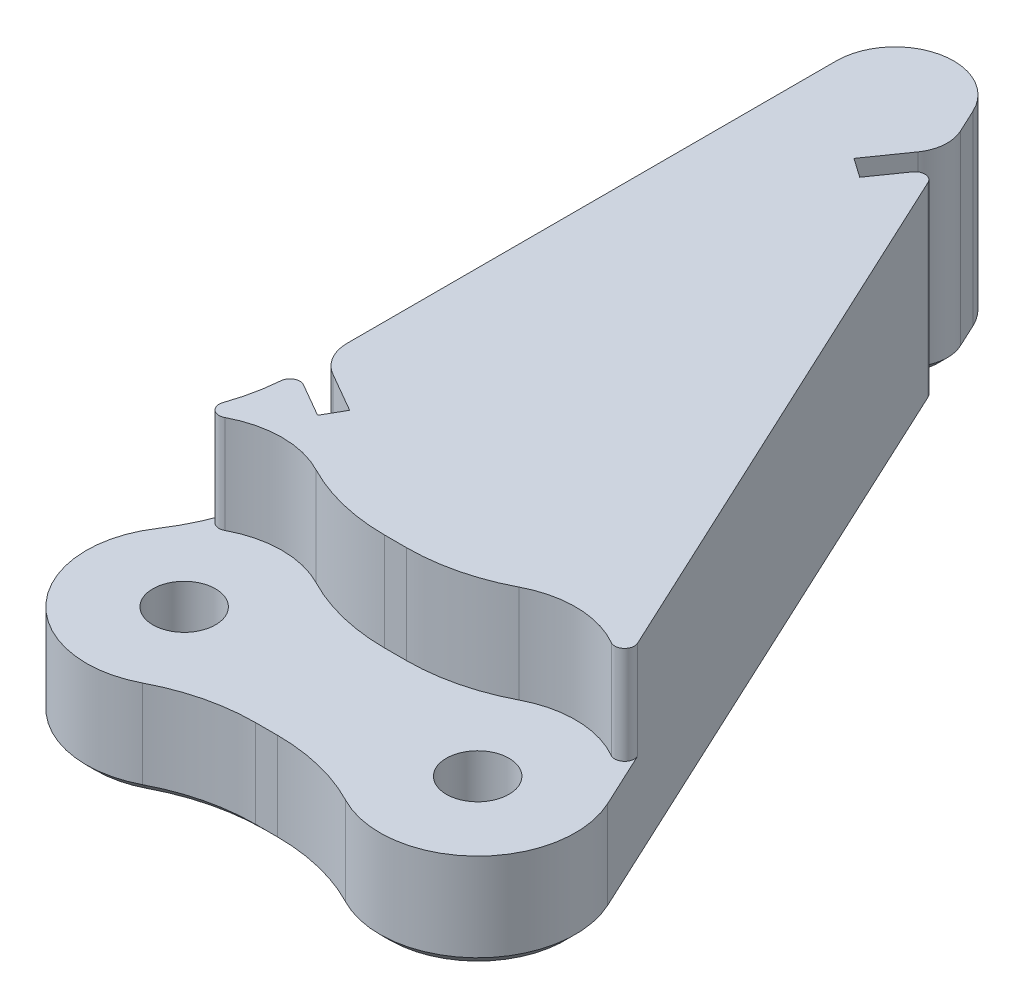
ISO-10303-21;
HEADER;
FILE_DESCRIPTION(('STEP AP214'),'2;1');
FILE_NAME('part.step','',(''),(''),'','','');
FILE_SCHEMA(('AUTOMOTIVE_DESIGN { 1 0 10303 214 1 1 1 1 }'));
ENDSEC;
DATA;
#1=APPLICATION_CONTEXT('core data for automotive mechanical design processes');
#2=APPLICATION_PROTOCOL_DEFINITION('international standard','automotive_design',2000,#1);
#3=PRODUCT_CONTEXT('',#1,'mechanical');
#4=PRODUCT('Part','Part','',(#3));
#5=PRODUCT_RELATED_PRODUCT_CATEGORY('part','',(#4));
#6=PRODUCT_DEFINITION_FORMATION('','',#4);
#7=PRODUCT_DEFINITION_CONTEXT('part definition',#1,'design');
#8=PRODUCT_DEFINITION('design','',#6,#7);
#9=PRODUCT_DEFINITION_SHAPE('','',#8);
#10=(LENGTH_UNIT() NAMED_UNIT(*) SI_UNIT(.MILLI.,.METRE.));
#11=(NAMED_UNIT(*) PLANE_ANGLE_UNIT() SI_UNIT($,.RADIAN.));
#12=(NAMED_UNIT(*) SI_UNIT($,.STERADIAN.) SOLID_ANGLE_UNIT());
#13=UNCERTAINTY_MEASURE_WITH_UNIT(LENGTH_MEASURE(1.E-05),#10,'distance_accuracy_value','');
#14=(GEOMETRIC_REPRESENTATION_CONTEXT(3) GLOBAL_UNCERTAINTY_ASSIGNED_CONTEXT((#13)) GLOBAL_UNIT_ASSIGNED_CONTEXT((#10,
#11,#12)) REPRESENTATION_CONTEXT('',''));
#15=CARTESIAN_POINT('',(0.,0.,0.));
#16=DIRECTION('',(0.,0.,1.));
#17=DIRECTION('',(1.,0.,0.));
#18=AXIS2_PLACEMENT_3D('',#15,#16,#17);
#19=CARTESIAN_POINT('',(16.8524460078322,10.,-7.85842463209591));
#20=DIRECTION('',(-0.906307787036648,0.,0.422618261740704));
#21=DIRECTION('',(0.422618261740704,0.,0.906307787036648));
#22=AXIS2_PLACEMENT_3D('',#19,#20,#21);
#23=PLANE('',#22);
#24=DIRECTION('',(0.,-1.,0.));
#25=VECTOR('',#24,1.);
#26=CARTESIAN_POINT('',(19.5315389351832,5.,-2.11309130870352));
#27=LINE('',#26,#25);
#28=CARTESIAN_POINT('',(19.5315389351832,0.50000000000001,-2.11309130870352));
#29=VERTEX_POINT('',#28);
#30=CARTESIAN_POINT('',(19.5315389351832,5.,-2.11309130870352));
#31=VERTEX_POINT('',#30);
#32=EDGE_CURVE('E374',#29,#31,#27,.F.);
#33=ORIENTED_EDGE('',*,*,#32,.F.);
#34=DIRECTION('',(-0.422618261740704,0.,-0.906307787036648));
#35=VECTOR('',#34,1.);
#36=CARTESIAN_POINT('',(16.8524460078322,0.500000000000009,-7.85842463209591));
#37=LINE('',#36,#35);
#38=CARTESIAN_POINT('',(5.22706420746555,0.500000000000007,-32.7891363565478));
#39=VERTEX_POINT('',#38);
#40=EDGE_CURVE('E72',#29,#39,#37,.T.);
#41=ORIENTED_EDGE('',*,*,#40,.T.);
#42=DIRECTION('',(0.,1.,0.));
#43=VECTOR('',#42,1.);
#44=CARTESIAN_POINT('',(5.22706420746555,10.,-32.7891363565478));
#45=LINE('',#44,#43);
#46=CARTESIAN_POINT('',(5.22706420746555,10.,-32.7891363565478));
#47=VERTEX_POINT('',#46);
#48=EDGE_CURVE('E459',#39,#47,#45,.T.);
#49=ORIENTED_EDGE('',*,*,#48,.T.);
#50=DIRECTION('',(-0.422618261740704,0.,-0.906307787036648));
#51=VECTOR('',#50,1.);
#52=CARTESIAN_POINT('',(16.8524460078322,10.,-7.85842463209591));
#53=LINE('',#52,#51);
#54=CARTESIAN_POINT('',(18.1951026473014,10.,-4.97908817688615));
#55=VERTEX_POINT('',#54);
#56=EDGE_CURVE('E390',#55,#47,#53,.T.);
#57=ORIENTED_EDGE('',*,*,#56,.F.);
#58=DIRECTION('',(0.,1.,0.));
#59=VECTOR('',#58,1.);
#60=CARTESIAN_POINT('',(18.1951026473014,5.,-4.97908817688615));
#61=LINE('',#60,#59);
#62=CARTESIAN_POINT('',(18.1951026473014,5.,-4.97908817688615));
#63=VERTEX_POINT('',#62);
#64=EDGE_CURVE('E423',#55,#63,#61,.F.);
#65=ORIENTED_EDGE('',*,*,#64,.T.);
#66=DIRECTION('',(0.422618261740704,0.,0.906307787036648));
#67=VECTOR('',#66,1.);
#68=CARTESIAN_POINT('',(16.8524460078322,5.,-7.85842463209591));
#69=LINE('',#68,#67);
#70=EDGE_CURVE('E420',#63,#31,#69,.T.);
#71=ORIENTED_EDGE('',*,*,#70,.T.);
#72=EDGE_LOOP('',(#33,#41,#49,#57,#65,#71));
#73=FACE_BOUND('',#72,.T.);
#74=ADVANCED_FACE('F47',(#73),#23,.F.);
#75=CARTESIAN_POINT('',(6.93613725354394,10.,-13.3));
#76=DIRECTION('',(0.,-1.,0.));
#77=DIRECTION('',(0.,0.,-1.));
#78=AXIS2_PLACEMENT_3D('',#75,#76,#77);
#79=CYLINDRICAL_SURFACE('',#78,10.);
#80=CARTESIAN_POINT('',(6.93613725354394,5.,-13.3));
#81=DIRECTION('',(0.,1.,0.));
#82=DIRECTION('',(0.,0.,1.));
#83=AXIS2_PLACEMENT_3D('',#80,#81,#82);
#84=CIRCLE('',#83,10.);
#85=CARTESIAN_POINT('',(6.93613725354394,5.,-3.3));
#86=VERTEX_POINT('',#85);
#87=CARTESIAN_POINT('',(2.31204575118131,5.,-4.43333333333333));
#88=VERTEX_POINT('',#87);
#89=EDGE_CURVE('E339',#86,#88,#84,.F.);
#90=ORIENTED_EDGE('',*,*,#89,.F.);
#91=DIRECTION('',(0.,-1.,0.));
#92=VECTOR('',#91,1.);
#93=CARTESIAN_POINT('',(6.93613725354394,10.,-3.3));
#94=LINE('',#93,#92);
#95=CARTESIAN_POINT('',(6.93613725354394,10.,-3.3));
#96=VERTEX_POINT('',#95);
#97=EDGE_CURVE('E417',#96,#86,#94,.T.);
#98=ORIENTED_EDGE('',*,*,#97,.F.);
#99=CARTESIAN_POINT('',(6.93613725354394,10.,-13.3));
#100=DIRECTION('',(0.,1.,0.));
#101=DIRECTION('',(0.,0.,1.));
#102=AXIS2_PLACEMENT_3D('',#99,#100,#101);
#103=CIRCLE('',#102,10.);
#104=CARTESIAN_POINT('',(2.31204575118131,10.,-4.43333333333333));
#105=VERTEX_POINT('',#104);
#106=EDGE_CURVE('E379',#96,#105,#103,.F.);
#107=ORIENTED_EDGE('',*,*,#106,.T.);
#108=DIRECTION('',(0.,-1.,0.));
#109=VECTOR('',#108,1.);
#110=CARTESIAN_POINT('',(2.31204575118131,10.,-4.43333333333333));
#111=LINE('',#110,#109);
#112=EDGE_CURVE('E402',#105,#88,#111,.T.);
#113=ORIENTED_EDGE('',*,*,#112,.T.);
#114=EDGE_LOOP('',(#90,#98,#107,#113));
#115=FACE_BOUND('',#114,.T.);
#116=ADVANCED_FACE('F799',(#115),#79,.T.);
#117=CARTESIAN_POINT('',(0.,10.,-3.3));
#118=DIRECTION('',(0.,0.,-1.));
#119=DIRECTION('',(-1.,0.,0.));
#120=AXIS2_PLACEMENT_3D('',#117,#118,#119);
#121=PLANE('',#120);
#122=ORIENTED_EDGE('',*,*,#97,.T.);
#123=DIRECTION('',(1.,0.,0.));
#124=VECTOR('',#123,1.);
#125=CARTESIAN_POINT('',(0.,5.,-3.3));
#126=LINE('',#125,#124);
#127=CARTESIAN_POINT('',(8.06386274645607,5.,-3.3));
#128=VERTEX_POINT('',#127);
#129=EDGE_CURVE('E337',#86,#128,#126,.T.);
#130=ORIENTED_EDGE('',*,*,#129,.T.);
#131=DIRECTION('',(0.,-1.,0.));
#132=VECTOR('',#131,1.);
#133=CARTESIAN_POINT('',(8.06386274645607,10.,-3.3));
#134=LINE('',#133,#132);
#135=CARTESIAN_POINT('',(8.06386274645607,10.,-3.3));
#136=VERTEX_POINT('',#135);
#137=EDGE_CURVE('E414',#136,#128,#134,.T.);
#138=ORIENTED_EDGE('',*,*,#137,.F.);
#139=DIRECTION('',(1.,0.,0.));
#140=VECTOR('',#139,1.);
#141=CARTESIAN_POINT('',(0.,10.,-3.3));
#142=LINE('',#141,#140);
#143=EDGE_CURVE('E382',#96,#136,#142,.T.);
#144=ORIENTED_EDGE('',*,*,#143,.F.);
#145=EDGE_LOOP('',(#122,#130,#138,#144));
#146=FACE_BOUND('',#145,.T.);
#147=ADVANCED_FACE('F806',(#146),#121,.F.);
#148=CARTESIAN_POINT('',(8.06386274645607,10.,-13.3));
#149=DIRECTION('',(0.,-1.,0.));
#150=DIRECTION('',(0.,0.,-1.));
#151=AXIS2_PLACEMENT_3D('',#148,#149,#150);
#152=CYLINDRICAL_SURFACE('',#151,10.);
#153=ORIENTED_EDGE('',*,*,#137,.T.);
#154=CARTESIAN_POINT('',(8.06386274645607,5.,-13.3));
#155=DIRECTION('',(0.,1.,0.));
#156=DIRECTION('',(0.,0.,1.));
#157=AXIS2_PLACEMENT_3D('',#154,#155,#156);
#158=CIRCLE('',#157,10.);
#159=CARTESIAN_POINT('',(12.6879542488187,5.,-4.43333333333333));
#160=VERTEX_POINT('',#159);
#161=EDGE_CURVE('E359',#128,#160,#158,.T.);
#162=ORIENTED_EDGE('',*,*,#161,.T.);
#163=DIRECTION('',(0.,-1.,0.));
#164=VECTOR('',#163,1.);
#165=CARTESIAN_POINT('',(12.6879542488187,10.,-4.43333333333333));
#166=LINE('',#165,#164);
#167=CARTESIAN_POINT('',(12.6879542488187,10.,-4.43333333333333));
#168=VERTEX_POINT('',#167);
#169=EDGE_CURVE('E411',#168,#160,#166,.T.);
#170=ORIENTED_EDGE('',*,*,#169,.F.);
#171=CARTESIAN_POINT('',(8.06386274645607,10.,-13.3));
#172=DIRECTION('',(0.,1.,0.));
#173=DIRECTION('',(0.,0.,1.));
#174=AXIS2_PLACEMENT_3D('',#171,#172,#173);
#175=CIRCLE('',#174,10.);
#176=EDGE_CURVE('E384',#136,#168,#175,.T.);
#177=ORIENTED_EDGE('',*,*,#176,.F.);
#178=EDGE_LOOP('',(#153,#162,#170,#177));
#179=FACE_BOUND('',#178,.T.);
#180=ADVANCED_FACE('F815',(#179),#152,.T.);
#181=CARTESIAN_POINT('',(15.,10.,0.));
#182=DIRECTION('',(0.,-1.,0.));
#183=DIRECTION('',(0.,0.,-1.));
#184=AXIS2_PLACEMENT_3D('',#181,#182,#183);
#185=CYLINDRICAL_SURFACE('',#184,5.);
#186=CARTESIAN_POINT('',(15.,5.,0.));
#187=DIRECTION('',(0.,1.,0.));
#188=DIRECTION('',(0.,0.,1.));
#189=AXIS2_PLACEMENT_3D('',#186,#187,#188);
#190=CIRCLE('',#189,5.);
#191=CARTESIAN_POINT('',(17.4926806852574,5.,-4.33434458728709));
#192=VERTEX_POINT('',#191);
#193=EDGE_CURVE('E355',#192,#160,#190,.T.);
#194=ORIENTED_EDGE('',*,*,#193,.F.);
#195=DIRECTION('',(0.,-1.,0.));
#196=VECTOR('',#195,1.);
#197=CARTESIAN_POINT('',(17.4926806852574,10.,-4.33434458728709));
#198=LINE('',#197,#196);
#199=CARTESIAN_POINT('',(17.4926806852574,10.,-4.33434458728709));
#200=VERTEX_POINT('',#199);
#201=EDGE_CURVE('E426',#192,#200,#198,.F.);
#202=ORIENTED_EDGE('',*,*,#201,.T.);
#203=CARTESIAN_POINT('',(15.,10.,0.));
#204=DIRECTION('',(0.,1.,0.));
#205=DIRECTION('',(0.,0.,1.));
#206=AXIS2_PLACEMENT_3D('',#203,#204,#205);
#207=CIRCLE('',#206,5.);
#208=EDGE_CURVE('E387',#200,#168,#207,.T.);
#209=ORIENTED_EDGE('',*,*,#208,.T.);
#210=ORIENTED_EDGE('',*,*,#169,.T.);
#211=EDGE_LOOP('',(#194,#202,#209,#210));
#212=FACE_BOUND('',#211,.T.);
#213=ADVANCED_FACE('F683',(#212),#185,.F.);
#214=DIRECTION('',(0.,1.,0.));
#215=VECTOR('',#214,1.);
#216=CARTESIAN_POINT('',(3.7874714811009,10.,-35.876352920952));
#217=LINE('',#216,#215);
#218=CARTESIAN_POINT('',(3.7874714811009,10.,-35.876352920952));
#219=VERTEX_POINT('',#218);
#220=CARTESIAN_POINT('',(3.7874714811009,0.500000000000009,-35.876352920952));
#221=VERTEX_POINT('',#220);
#222=EDGE_CURVE('E451',#219,#221,#217,.F.);
#223=ORIENTED_EDGE('',*,*,#222,.T.);
#224=DIRECTION('',(-0.422618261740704,0.,-0.906307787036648));
#225=VECTOR('',#224,1.);
#226=CARTESIAN_POINT('',(16.8524460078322,0.500000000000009,-7.85842463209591));
#227=LINE('',#226,#225);
#228=CARTESIAN_POINT('',(3.21892336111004,0.500000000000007,-37.095608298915));
#229=VERTEX_POINT('',#228);
#230=EDGE_CURVE('E527',#221,#229,#227,.T.);
#231=ORIENTED_EDGE('',*,*,#230,.T.);
#232=DIRECTION('',(0.,-1.,0.));
#233=VECTOR('',#232,1.);
#234=CARTESIAN_POINT('',(3.21892336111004,10.,-37.095608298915));
#235=LINE('',#234,#233);
#236=CARTESIAN_POINT('',(3.21892336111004,10.,-37.095608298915));
#237=VERTEX_POINT('',#236);
#238=EDGE_CURVE('E408',#237,#229,#235,.T.);
#239=ORIENTED_EDGE('',*,*,#238,.F.);
#240=EDGE_CURVE('E389',#219,#237,#53,.T.);
#241=ORIENTED_EDGE('',*,*,#240,.F.);
#242=EDGE_LOOP('',(#223,#231,#239,#241));
#243=FACE_BOUND('',#242,.T.);
#244=ADVANCED_FACE('F715',(#243),#23,.F.);
#245=CARTESIAN_POINT('',(0.499999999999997,10.,-35.8277535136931));
#246=DIRECTION('',(0.,-1.,0.));
#247=DIRECTION('',(0.,0.,-1.));
#248=AXIS2_PLACEMENT_3D('',#245,#246,#247);
#249=CYLINDRICAL_SURFACE('',#248,3.);
#250=ORIENTED_EDGE('',*,*,#238,.T.);
#251=CARTESIAN_POINT('',(0.499999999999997,0.500000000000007,-35.8277535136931));
#252=DIRECTION('',(0.,1.,0.));
#253=DIRECTION('',(0.,0.,1.));
#254=AXIS2_PLACEMENT_3D('',#251,#252,#253);
#255=CIRCLE('',#254,3.);
#256=CARTESIAN_POINT('',(-2.5,0.500000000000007,-35.8277535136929));
#257=VERTEX_POINT('',#256);
#258=EDGE_CURVE('E529',#229,#257,#255,.T.);
#259=ORIENTED_EDGE('',*,*,#258,.T.);
#260=DIRECTION('',(0.,-1.,0.));
#261=VECTOR('',#260,1.);
#262=CARTESIAN_POINT('',(-2.5,10.,-35.8277535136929));
#263=LINE('',#262,#261);
#264=CARTESIAN_POINT('',(-2.5,10.,-35.8277535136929));
#265=VERTEX_POINT('',#264);
#266=EDGE_CURVE('E405',#265,#257,#263,.T.);
#267=ORIENTED_EDGE('',*,*,#266,.F.);
#268=CARTESIAN_POINT('',(0.499999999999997,10.,-35.8277535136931));
#269=DIRECTION('',(0.,1.,0.));
#270=DIRECTION('',(0.,0.,1.));
#271=AXIS2_PLACEMENT_3D('',#268,#269,#270);
#272=CIRCLE('',#271,3.);
#273=EDGE_CURVE('E392',#237,#265,#272,.T.);
#274=ORIENTED_EDGE('',*,*,#273,.F.);
#275=EDGE_LOOP('',(#250,#259,#267,#274));
#276=FACE_BOUND('',#275,.T.);
#277=ADVANCED_FACE('F738',(#276),#249,.T.);
#278=CARTESIAN_POINT('',(-2.5,10.,0.));
#279=DIRECTION('',(1.,0.,0.));
#280=DIRECTION('',(0.,0.,-1.));
#281=AXIS2_PLACEMENT_3D('',#278,#279,#280);
#282=PLANE('',#281);
#283=ORIENTED_EDGE('',*,*,#266,.T.);
#284=DIRECTION('',(0.,0.,1.));
#285=VECTOR('',#284,1.);
#286=CARTESIAN_POINT('',(-2.5,0.500000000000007,0.));
#287=LINE('',#286,#285);
#288=CARTESIAN_POINT('',(-2.5,0.500000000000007,-10.8319031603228));
#289=VERTEX_POINT('',#288);
#290=EDGE_CURVE('E531',#257,#289,#287,.T.);
#291=ORIENTED_EDGE('',*,*,#290,.T.);
#292=DIRECTION('',(0.,1.,0.));
#293=VECTOR('',#292,1.);
#294=CARTESIAN_POINT('',(-2.5,10.,-10.8319031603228));
#295=LINE('',#294,#293);
#296=CARTESIAN_POINT('',(-2.5,10.,-10.8319031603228));
#297=VERTEX_POINT('',#296);
#298=EDGE_CURVE('E454',#289,#297,#295,.T.);
#299=ORIENTED_EDGE('',*,*,#298,.T.);
#300=DIRECTION('',(0.,0.,1.));
#301=VECTOR('',#300,1.);
#302=CARTESIAN_POINT('',(-2.5,10.,0.));
#303=LINE('',#302,#301);
#304=EDGE_CURVE('E394',#265,#297,#303,.T.);
#305=ORIENTED_EDGE('',*,*,#304,.F.);
#306=EDGE_LOOP('',(#283,#291,#299,#305));
#307=FACE_BOUND('',#306,.T.);
#308=ADVANCED_FACE('F743',(#307),#282,.F.);
#309=CARTESIAN_POINT('',(-12.5,10.,-8.2915619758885));
#310=DIRECTION('',(0.,-1.,0.));
#311=DIRECTION('',(0.,0.,-1.));
#312=AXIS2_PLACEMENT_3D('',#309,#310,#311);
#313=CYLINDRICAL_SURFACE('',#312,10.);
#314=DIRECTION('',(0.,-1.,0.));
#315=VECTOR('',#314,1.);
#316=CARTESIAN_POINT('',(-2.53253489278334,10.,-7.48555990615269));
#317=LINE('',#316,#315);
#318=CARTESIAN_POINT('',(-2.53253489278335,10.,-7.48555990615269));
#319=VERTEX_POINT('',#318);
#320=CARTESIAN_POINT('',(-2.53253489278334,0.500000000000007,-7.48555990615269));
#321=VERTEX_POINT('',#320);
#322=EDGE_CURVE('E467',#319,#321,#317,.T.);
#323=ORIENTED_EDGE('',*,*,#322,.T.);
#324=CARTESIAN_POINT('',(-12.5,0.500000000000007,-8.2915619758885));
#325=DIRECTION('',(0.,1.,0.));
#326=DIRECTION('',(0.,0.,1.));
#327=AXIS2_PLACEMENT_3D('',#324,#325,#326);
#328=CIRCLE('',#327,10.);
#329=CARTESIAN_POINT('',(-4.16666666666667,0.500000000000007,-2.76385399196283));
#330=VERTEX_POINT('',#329);
#331=EDGE_CURVE('E542',#321,#330,#328,.F.);
#332=ORIENTED_EDGE('',*,*,#331,.T.);
#333=DIRECTION('',(0.,-1.,0.));
#334=VECTOR('',#333,1.);
#335=CARTESIAN_POINT('',(-4.16666666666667,2.5,-2.76385399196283));
#336=LINE('',#335,#334);
#337=CARTESIAN_POINT('',(-4.16666666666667,5.,-2.76385399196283));
#338=VERTEX_POINT('',#337);
#339=EDGE_CURVE('E376',#338,#330,#336,.T.);
#340=ORIENTED_EDGE('',*,*,#339,.F.);
#341=CARTESIAN_POINT('',(-12.5,5.,-8.2915619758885));
#342=DIRECTION('',(0.,1.,0.));
#343=DIRECTION('',(0.,0.,1.));
#344=AXIS2_PLACEMENT_3D('',#341,#342,#343);
#345=CIRCLE('',#344,10.);
#346=CARTESIAN_POINT('',(-3.04946403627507,5.,-5.02240765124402));
#347=VERTEX_POINT('',#346);
#348=EDGE_CURVE('E438',#338,#347,#345,.T.);
#349=ORIENTED_EDGE('',*,*,#348,.T.);
#350=DIRECTION('',(0.,-1.,0.));
#351=VECTOR('',#350,1.);
#352=CARTESIAN_POINT('',(-3.04946403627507,10.,-5.02240765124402));
#353=LINE('',#352,#351);
#354=CARTESIAN_POINT('',(-3.04946403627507,10.,-5.02240765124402));
#355=VERTEX_POINT('',#354);
#356=EDGE_CURVE('E435',#347,#355,#353,.F.);
#357=ORIENTED_EDGE('',*,*,#356,.T.);
#358=CARTESIAN_POINT('',(-12.5,10.,-8.2915619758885));
#359=DIRECTION('',(0.,1.,0.));
#360=DIRECTION('',(0.,0.,1.));
#361=AXIS2_PLACEMENT_3D('',#358,#359,#360);
#362=CIRCLE('',#361,10.);
#363=EDGE_CURVE('E397',#319,#355,#362,.F.);
#364=ORIENTED_EDGE('',*,*,#363,.F.);
#365=EDGE_LOOP('',(#323,#332,#340,#349,#357,#364));
#366=FACE_BOUND('',#365,.T.);
#367=ADVANCED_FACE('F626',(#366),#313,.F.);
#368=CARTESIAN_POINT('',(0.,10.,0.));
#369=DIRECTION('',(0.,-1.,0.));
#370=DIRECTION('',(0.,0.,-1.));
#371=AXIS2_PLACEMENT_3D('',#368,#369,#370);
#372=CYLINDRICAL_SURFACE('',#371,5.);
#373=CARTESIAN_POINT('',(0.,10.,0.));
#374=DIRECTION('',(0.,1.,0.));
#375=DIRECTION('',(0.,0.,1.));
#376=AXIS2_PLACEMENT_3D('',#373,#374,#375);
#377=CIRCLE('',#376,5.);
#378=CARTESIAN_POINT('',(-2.34267021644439,10.,-4.41722721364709));
#379=VERTEX_POINT('',#378);
#380=EDGE_CURVE('E399',#105,#379,#377,.T.);
#381=ORIENTED_EDGE('',*,*,#380,.T.);
#382=DIRECTION('',(0.,-1.,0.));
#383=VECTOR('',#382,1.);
#384=CARTESIAN_POINT('',(-2.34267021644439,10.,-4.41722721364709));
#385=LINE('',#384,#383);
#386=CARTESIAN_POINT('',(-2.34267021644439,5.,-4.41722721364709));
#387=VERTEX_POINT('',#386);
#388=EDGE_CURVE('E432',#379,#387,#385,.T.);
#389=ORIENTED_EDGE('',*,*,#388,.T.);
#390=CARTESIAN_POINT('',(0.,5.,0.));
#391=DIRECTION('',(0.,1.,0.));
#392=DIRECTION('',(0.,0.,1.));
#393=AXIS2_PLACEMENT_3D('',#390,#391,#392);
#394=CIRCLE('',#393,5.);
#395=EDGE_CURVE('E343',#88,#387,#394,.T.);
#396=ORIENTED_EDGE('',*,*,#395,.F.);
#397=ORIENTED_EDGE('',*,*,#112,.F.);
#398=EDGE_LOOP('',(#381,#389,#396,#397));
#399=FACE_BOUND('',#398,.T.);
#400=ADVANCED_FACE('F635',(#399),#372,.F.);
#401=CARTESIAN_POINT('',(0.,10.,0.));
#402=DIRECTION('',(0.,1.,0.));
#403=DIRECTION('',(0.,0.,1.));
#404=AXIS2_PLACEMENT_3D('',#401,#402,#403);
#405=PLANE('',#404);
#406=ORIENTED_EDGE('',*,*,#56,.T.);
#407=CARTESIAN_POINT('',(4.77391031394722,10.,-32.5778272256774));
#408=DIRECTION('',(0.,1.,0.));
#409=DIRECTION('',(0.,0.,1.));
#410=AXIS2_PLACEMENT_3D('',#407,#408,#409);
#411=CIRCLE('',#410,0.5);
#412=CARTESIAN_POINT('',(4.36433429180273,10.,-32.864615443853));
#413=VERTEX_POINT('',#412);
#414=EDGE_CURVE('E463',#47,#413,#411,.T.);
#415=ORIENTED_EDGE('',*,*,#414,.T.);
#416=DIRECTION('',(0.573576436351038,0.,-0.819152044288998));
#417=VECTOR('',#416,1.);
#418=CARTESIAN_POINT('',(3.25093394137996,10.,-31.2745149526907));
#419=LINE('',#418,#417);
#420=CARTESIAN_POINT('',(3.25093394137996,10.,-31.2745149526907));
#421=VERTEX_POINT('',#420);
#422=EDGE_CURVE('E322',#421,#413,#419,.T.);
#423=ORIENTED_EDGE('',*,*,#422,.F.);
#424=DIRECTION('',(0.819152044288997,0.,0.573576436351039));
#425=VECTOR('',#424,1.);
#426=CARTESIAN_POINT('',(2.26795148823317,10.,-31.9628066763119));
#427=LINE('',#426,#425);
#428=CARTESIAN_POINT('',(2.26795148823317,10.,-31.9628066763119));
#429=VERTEX_POINT('',#428);
#430=EDGE_CURVE('E327',#429,#421,#427,.T.);
#431=ORIENTED_EDGE('',*,*,#430,.F.);
#432=DIRECTION('',(-0.573576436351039,0.,0.819152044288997));
#433=VECTOR('',#432,1.);
#434=CARTESIAN_POINT('',(4.2754690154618,10.,-34.8298388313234));
#435=LINE('',#434,#433);
#436=CARTESIAN_POINT('',(3.61315999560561,10.,-33.8839635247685));
#437=VERTEX_POINT('',#436);
#438=EDGE_CURVE('E310',#437,#429,#435,.T.);
#439=ORIENTED_EDGE('',*,*,#438,.F.);
#440=CARTESIAN_POINT('',(1.97485590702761,10.,-35.0311163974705));
#441=DIRECTION('',(0.,1.,0.));
#442=DIRECTION('',(0.,0.,1.));
#443=AXIS2_PLACEMENT_3D('',#440,#441,#442);
#444=CIRCLE('',#443,2.);
#445=EDGE_CURVE('E449',#437,#219,#444,.T.);
#446=ORIENTED_EDGE('',*,*,#445,.T.);
#447=ORIENTED_EDGE('',*,*,#240,.T.);
#448=ORIENTED_EDGE('',*,*,#273,.T.);
#449=ORIENTED_EDGE('',*,*,#304,.T.);
#450=CARTESIAN_POINT('',(-0.500000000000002,10.,-10.8319031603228));
#451=DIRECTION('',(0.,1.,0.));
#452=DIRECTION('',(0.,0.,1.));
#453=AXIS2_PLACEMENT_3D('',#450,#451,#452);
#454=CIRCLE('',#453,2.);
#455=CARTESIAN_POINT('',(-1.50000000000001,10.,-9.09985235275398));
#456=VERTEX_POINT('',#455);
#457=EDGE_CURVE('E447',#297,#456,#454,.T.);
#458=ORIENTED_EDGE('',*,*,#457,.T.);
#459=DIRECTION('',(-0.866025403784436,0.,-0.500000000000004));
#460=VECTOR('',#459,1.);
#461=CARTESIAN_POINT('',(0.531088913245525,10.,-7.92720262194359));
#462=LINE('',#461,#460);
#463=CARTESIAN_POINT('',(0.531088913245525,10.,-7.92720262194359));
#464=VERTEX_POINT('',#463);
#465=EDGE_CURVE('E301',#464,#456,#462,.T.);
#466=ORIENTED_EDGE('',*,*,#465,.F.);
#467=DIRECTION('',(0.500000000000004,0.,-0.866025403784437));
#468=VECTOR('',#467,1.);
#469=CARTESIAN_POINT('',(-0.0689110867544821,10.,-6.88797213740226));
#470=LINE('',#469,#468);
#471=CARTESIAN_POINT('',(-0.0689110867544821,10.,-6.88797213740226));
#472=VERTEX_POINT('',#471);
#473=EDGE_CURVE('E294',#472,#464,#470,.T.);
#474=ORIENTED_EDGE('',*,*,#473,.F.);
#475=DIRECTION('',(0.866025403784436,0.,0.500000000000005));
#476=VECTOR('',#475,1.);
#477=CARTESIAN_POINT('',(-2.5,10.,-8.2915619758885));
#478=LINE('',#477,#476);
#479=CARTESIAN_POINT('',(-1.78416163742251,10.,-7.87827250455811));
#480=VERTEX_POINT('',#479);
#481=EDGE_CURVE('E304',#480,#472,#478,.T.);
#482=ORIENTED_EDGE('',*,*,#481,.F.);
#483=CARTESIAN_POINT('',(-2.03416163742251,10.,-7.4452598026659));
#484=DIRECTION('',(0.,1.,0.));
#485=DIRECTION('',(0.,0.,1.));
#486=AXIS2_PLACEMENT_3D('',#483,#484,#485);
#487=CIRCLE('',#486,0.5);
#488=EDGE_CURVE('E461',#480,#319,#487,.T.);
#489=ORIENTED_EDGE('',*,*,#488,.T.);
#490=ORIENTED_EDGE('',*,*,#363,.T.);
#491=CARTESIAN_POINT('',(-2.57693723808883,10.,-4.8589499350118));
#492=DIRECTION('',(0.,1.,0.));
#493=DIRECTION('',(0.,0.,1.));
#494=AXIS2_PLACEMENT_3D('',#491,#492,#493);
#495=CIRCLE('',#494,0.5);
#496=EDGE_CURVE('E428',#355,#379,#495,.T.);
#497=ORIENTED_EDGE('',*,*,#496,.T.);
#498=ORIENTED_EDGE('',*,*,#380,.F.);
#499=ORIENTED_EDGE('',*,*,#106,.F.);
#500=ORIENTED_EDGE('',*,*,#143,.T.);
#501=ORIENTED_EDGE('',*,*,#176,.T.);
#502=ORIENTED_EDGE('',*,*,#208,.F.);
#503=CARTESIAN_POINT('',(17.7419487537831,10.,-4.7677790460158));
#504=DIRECTION('',(0.,1.,0.));
#505=DIRECTION('',(0.,0.,1.));
#506=AXIS2_PLACEMENT_3D('',#503,#504,#505);
#507=CIRCLE('',#506,0.5);
#508=EDGE_CURVE('E430',#200,#55,#507,.T.);
#509=ORIENTED_EDGE('',*,*,#508,.T.);
#510=EDGE_LOOP('',(#406,#415,#423,#431,#439,#446,#447,#448,#449,#458,#466,#474,#482,#489,#490,
#497,#498,#499,#500,#501,#502,#509));
#511=FACE_BOUND('',#510,.T.);
#512=ADVANCED_FACE('F313',(#511),#405,.T.);
#513=CARTESIAN_POINT('',(0.,0.,0.));
#514=DIRECTION('',(0.,1.,0.));
#515=DIRECTION('',(0.,0.,1.));
#516=AXIS2_PLACEMENT_3D('',#513,#514,#515);
#517=PLANE('',#516);
#518=CARTESIAN_POINT('',(15.,0.,0.));
#519=DIRECTION('',(0.,1.,0.));
#520=DIRECTION('',(0.,0.,1.));
#521=AXIS2_PLACEMENT_3D('',#518,#519,#520);
#522=CIRCLE('',#521,2.1);
#523=CARTESIAN_POINT('',(15.,0.,2.1));
#524=VERTEX_POINT('',#523);
#525=EDGE_CURVE('E511',#524,#524,#522,.T.);
#526=ORIENTED_EDGE('',*,*,#525,.T.);
#527=EDGE_LOOP('',(#526));
#528=FACE_BOUND('',#527,.T.);
#529=CARTESIAN_POINT('',(0.,0.,0.));
#530=DIRECTION('',(0.,1.,0.));
#531=DIRECTION('',(0.,0.,1.));
#532=AXIS2_PLACEMENT_3D('',#529,#530,#531);
#533=CIRCLE('',#532,2.1);
#534=CARTESIAN_POINT('',(0.,0.,2.1));
#535=VERTEX_POINT('',#534);
#536=EDGE_CURVE('E508',#535,#535,#533,.T.);
#537=ORIENTED_EDGE('',*,*,#536,.T.);
#538=EDGE_LOOP('',(#537));
#539=FACE_BOUND('',#538,.T.);
#540=DIRECTION('',(-0.573576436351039,0.,0.819152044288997));
#541=VECTOR('',#540,1.);
#542=CARTESIAN_POINT('',(-13.9053645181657,0.,-9.73664105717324));
#543=LINE('',#542,#541);
#544=CARTESIAN_POINT('',(3.20358397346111,0.,-34.170751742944));
#545=VERTEX_POINT('',#544);
#546=CARTESIAN_POINT('',(1.57158724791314,0.,-31.840018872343));
#547=VERTEX_POINT('',#546);
#548=EDGE_CURVE('E503',#545,#547,#543,.T.);
#549=ORIENTED_EDGE('',*,*,#548,.T.);
#550=DIRECTION('',(0.819152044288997,0.,0.573576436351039));
#551=VECTOR('',#550,1.);
#552=CARTESIAN_POINT('',(15.4769517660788,0.,-22.1033778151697));
#553=LINE('',#552,#551);
#554=CARTESIAN_POINT('',(3.37372174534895,0.,-30.5781507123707));
#555=VERTEX_POINT('',#554);
#556=EDGE_CURVE('E505',#547,#555,#553,.T.);
#557=ORIENTED_EDGE('',*,*,#556,.T.);
#558=DIRECTION('',(0.573576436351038,0.,-0.819152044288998));
#559=VECTOR('',#558,1.);
#560=CARTESIAN_POINT('',(-12.1032300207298,0.,-8.47477289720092));
#561=LINE('',#560,#559);
#562=CARTESIAN_POINT('',(4.77391031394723,0.,-32.5778272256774));
#563=VERTEX_POINT('',#562);
#564=EDGE_CURVE('E471',#555,#563,#561,.T.);
#565=ORIENTED_EDGE('',*,*,#564,.T.);
#566=DIRECTION('',(0.422618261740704,0.,0.906307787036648));
#567=VECTOR('',#566,1.);
#568=CARTESIAN_POINT('',(16.3992921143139,0.,-7.64711550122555));
#569=LINE('',#568,#567);
#570=CARTESIAN_POINT('',(19.0783850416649,0.,-1.90178217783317));
#571=VERTEX_POINT('',#570);
#572=EDGE_CURVE('E473',#563,#571,#569,.T.);
#573=ORIENTED_EDGE('',*,*,#572,.T.);
#574=CARTESIAN_POINT('',(15.,0.,0.));
#575=DIRECTION('',(0.,1.,0.));
#576=DIRECTION('',(0.,0.,1.));
#577=AXIS2_PLACEMENT_3D('',#574,#575,#576);
#578=CIRCLE('',#577,4.5);
#579=CARTESIAN_POINT('',(12.9191588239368,0.,3.99));
#580=VERTEX_POINT('',#579);
#581=EDGE_CURVE('E475',#571,#580,#578,.F.);
#582=ORIENTED_EDGE('',*,*,#581,.T.);
#583=CARTESIAN_POINT('',(8.06386274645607,0.,13.3));
#584=DIRECTION('',(0.,1.,0.));
#585=DIRECTION('',(0.,0.,1.));
#586=AXIS2_PLACEMENT_3D('',#583,#584,#585);
#587=CIRCLE('',#586,10.5);
#588=CARTESIAN_POINT('',(8.06386274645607,0.,2.8));
#589=VERTEX_POINT('',#588);
#590=EDGE_CURVE('E477',#580,#589,#587,.T.);
#591=ORIENTED_EDGE('',*,*,#590,.T.);
#592=DIRECTION('',(-1.,0.,0.));
#593=VECTOR('',#592,1.);
#594=CARTESIAN_POINT('',(0.,0.,2.8));
#595=LINE('',#594,#593);
#596=CARTESIAN_POINT('',(6.93613725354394,0.,2.8));
#597=VERTEX_POINT('',#596);
#598=EDGE_CURVE('E479',#589,#597,#595,.T.);
#599=ORIENTED_EDGE('',*,*,#598,.T.);
#600=CARTESIAN_POINT('',(6.93613725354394,0.,13.3));
#601=DIRECTION('',(0.,1.,0.));
#602=DIRECTION('',(0.,0.,1.));
#603=AXIS2_PLACEMENT_3D('',#600,#601,#602);
#604=CIRCLE('',#603,10.5);
#605=CARTESIAN_POINT('',(2.08084117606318,0.,3.99));
#606=VERTEX_POINT('',#605);
#607=EDGE_CURVE('E481',#597,#606,#604,.T.);
#608=ORIENTED_EDGE('',*,*,#607,.T.);
#609=CARTESIAN_POINT('',(0.,0.,0.));
#610=DIRECTION('',(0.,1.,0.));
#611=DIRECTION('',(0.,0.,1.));
#612=AXIS2_PLACEMENT_3D('',#609,#610,#611);
#613=CIRCLE('',#612,4.5);
#614=CARTESIAN_POINT('',(-3.75,0.,-2.48746859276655));
#615=VERTEX_POINT('',#614);
#616=EDGE_CURVE('E483',#606,#615,#613,.F.);
#617=ORIENTED_EDGE('',*,*,#616,.T.);
#618=CARTESIAN_POINT('',(-12.5,0.,-8.2915619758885));
#619=DIRECTION('',(0.,1.,0.));
#620=DIRECTION('',(0.,0.,1.));
#621=AXIS2_PLACEMENT_3D('',#618,#619,#620);
#622=CIRCLE('',#621,10.5);
#623=CARTESIAN_POINT('',(-2.03416163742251,0.,-7.4452598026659));
#624=VERTEX_POINT('',#623);
#625=EDGE_CURVE('E485',#615,#624,#622,.T.);
#626=ORIENTED_EDGE('',*,*,#625,.T.);
#627=DIRECTION('',(0.866025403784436,0.,0.500000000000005));
#628=VECTOR('',#627,1.);
#629=CARTESIAN_POINT('',(2.71535165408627,0.,-4.70312702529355));
#630=LINE('',#629,#628);
#631=CARTESIAN_POINT('',(0.114101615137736,0.,-6.20495943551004));
#632=VERTEX_POINT('',#631);
#633=EDGE_CURVE('E487',#624,#632,#630,.T.);
#634=ORIENTED_EDGE('',*,*,#633,.T.);
#635=DIRECTION('',(0.500000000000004,0.,-0.866025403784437));
#636=VECTOR('',#635,1.);
#637=CARTESIAN_POINT('',(-2.60125003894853,0.,-1.50183241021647));
#638=LINE('',#637,#636);
#639=CARTESIAN_POINT('',(1.21410161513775,0.,-8.11021532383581));
#640=VERTEX_POINT('',#639);
#641=EDGE_CURVE('E489',#632,#640,#638,.T.);
#642=ORIENTED_EDGE('',*,*,#641,.T.);
#643=DIRECTION('',(-0.866025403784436,0.,-0.500000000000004));
#644=VECTOR('',#643,1.);
#645=CARTESIAN_POINT('',(3.81535165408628,0.,-6.60838291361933));
#646=LINE('',#645,#644);
#647=CARTESIAN_POINT('',(-1.25000000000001,0.,-9.5328650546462));
#648=VERTEX_POINT('',#647);
#649=EDGE_CURVE('E491',#640,#648,#646,.T.);
#650=ORIENTED_EDGE('',*,*,#649,.T.);
#651=CARTESIAN_POINT('',(-0.500000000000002,0.,-10.8319031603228));
#652=DIRECTION('',(0.,1.,0.));
#653=DIRECTION('',(0.,0.,1.));
#654=AXIS2_PLACEMENT_3D('',#651,#652,#653);
#655=CIRCLE('',#654,1.5);
#656=CARTESIAN_POINT('',(-2.,0.,-10.8319031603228));
#657=VERTEX_POINT('',#656);
#658=EDGE_CURVE('E493',#648,#657,#655,.F.);
#659=ORIENTED_EDGE('',*,*,#658,.T.);
#660=DIRECTION('',(0.,0.,-1.));
#661=VECTOR('',#660,1.);
#662=CARTESIAN_POINT('',(-2.,0.,0.));
#663=LINE('',#662,#661);
#664=CARTESIAN_POINT('',(-2.,0.,-35.8277535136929));
#665=VERTEX_POINT('',#664);
#666=EDGE_CURVE('E495',#657,#665,#663,.T.);
#667=ORIENTED_EDGE('',*,*,#666,.T.);
#668=CARTESIAN_POINT('',(0.499999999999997,0.,-35.8277535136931));
#669=DIRECTION('',(0.,1.,0.));
#670=DIRECTION('',(0.,0.,1.));
#671=AXIS2_PLACEMENT_3D('',#668,#669,#670);
#672=CIRCLE('',#671,2.5);
#673=CARTESIAN_POINT('',(2.76576946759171,0.,-36.8842991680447));
#674=VERTEX_POINT('',#673);
#675=EDGE_CURVE('E497',#665,#674,#672,.F.);
#676=ORIENTED_EDGE('',*,*,#675,.T.);
#677=DIRECTION('',(0.422618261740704,0.,0.906307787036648));
#678=VECTOR('',#677,1.);
#679=CARTESIAN_POINT('',(16.3992921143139,0.,-7.64711550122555));
#680=LINE('',#679,#678);
#681=CARTESIAN_POINT('',(3.33431758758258,0.,-35.6650437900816));
#682=VERTEX_POINT('',#681);
#683=EDGE_CURVE('E499',#674,#682,#680,.T.);
#684=ORIENTED_EDGE('',*,*,#683,.T.);
#685=CARTESIAN_POINT('',(1.97485590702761,0.,-35.0311163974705));
#686=DIRECTION('',(0.,1.,0.));
#687=DIRECTION('',(0.,0.,1.));
#688=AXIS2_PLACEMENT_3D('',#685,#686,#687);
#689=CIRCLE('',#688,1.5);
#690=EDGE_CURVE('E501',#682,#545,#689,.F.);
#691=ORIENTED_EDGE('',*,*,#690,.T.);
#692=EDGE_LOOP('',(#549,#557,#565,#573,#582,#591,#599,#608,#617,#626,#634,#642,#650,#659,#667,
#676,#684,#691));
#693=FACE_BOUND('',#692,.T.);
#694=ADVANCED_FACE('F728',(#528,#539,#693),#517,.F.);
#695=CARTESIAN_POINT('',(0.,5.,0.));
#696=DIRECTION('',(0.,-1.,0.));
#697=DIRECTION('',(0.,0.,-1.));
#698=AXIS2_PLACEMENT_3D('',#695,#696,#697);
#699=CYLINDRICAL_SURFACE('',#698,5.);
#700=ORIENTED_EDGE('',*,*,#339,.T.);
#701=CARTESIAN_POINT('',(0.,0.500000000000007,0.));
#702=DIRECTION('',(0.,1.,0.));
#703=DIRECTION('',(0.,0.,1.));
#704=AXIS2_PLACEMENT_3D('',#701,#702,#703);
#705=CIRCLE('',#704,5.);
#706=CARTESIAN_POINT('',(2.31204575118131,0.500000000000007,4.43333333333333));
#707=VERTEX_POINT('',#706);
#708=EDGE_CURVE('E544',#330,#707,#705,.T.);
#709=ORIENTED_EDGE('',*,*,#708,.T.);
#710=DIRECTION('',(0.,-1.,0.));
#711=VECTOR('',#710,1.);
#712=CARTESIAN_POINT('',(2.31204575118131,5.,4.43333333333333));
#713=LINE('',#712,#711);
#714=CARTESIAN_POINT('',(2.31204575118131,5.,4.43333333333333));
#715=VERTEX_POINT('',#714);
#716=EDGE_CURVE('E371',#715,#707,#713,.T.);
#717=ORIENTED_EDGE('',*,*,#716,.F.);
#718=EDGE_CURVE('E342',#338,#715,#394,.T.);
#719=ORIENTED_EDGE('',*,*,#718,.F.);
#720=EDGE_LOOP('',(#700,#709,#717,#719));
#721=FACE_BOUND('',#720,.T.);
#722=ADVANCED_FACE('F644',(#721),#699,.T.);
#723=CARTESIAN_POINT('',(15.,5.,0.));
#724=DIRECTION('',(0.,-1.,0.));
#725=DIRECTION('',(0.,0.,-1.));
#726=AXIS2_PLACEMENT_3D('',#723,#724,#725);
#727=CYLINDRICAL_SURFACE('',#726,5.);
#728=DIRECTION('',(0.,-1.,0.));
#729=VECTOR('',#728,1.);
#730=CARTESIAN_POINT('',(12.6879542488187,5.,4.43333333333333));
#731=LINE('',#730,#729);
#732=CARTESIAN_POINT('',(12.6879542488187,5.,4.43333333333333));
#733=VERTEX_POINT('',#732);
#734=CARTESIAN_POINT('',(12.6879542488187,0.500000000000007,4.43333333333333));
#735=VERTEX_POINT('',#734);
#736=EDGE_CURVE('E362',#733,#735,#731,.T.);
#737=ORIENTED_EDGE('',*,*,#736,.T.);
#738=CARTESIAN_POINT('',(15.,0.500000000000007,0.));
#739=DIRECTION('',(0.,1.,0.));
#740=DIRECTION('',(0.,0.,1.));
#741=AXIS2_PLACEMENT_3D('',#738,#739,#740);
#742=CIRCLE('',#741,5.);
#743=EDGE_CURVE('E552',#735,#29,#742,.T.);
#744=ORIENTED_EDGE('',*,*,#743,.T.);
#745=ORIENTED_EDGE('',*,*,#32,.T.);
#746=EDGE_CURVE('E356',#733,#31,#190,.T.);
#747=ORIENTED_EDGE('',*,*,#746,.F.);
#748=EDGE_LOOP('',(#737,#744,#745,#747));
#749=FACE_BOUND('',#748,.T.);
#750=ADVANCED_FACE('F674',(#749),#727,.T.);
#751=CARTESIAN_POINT('',(6.93613725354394,5.,13.3));
#752=DIRECTION('',(0.,-1.,0.));
#753=DIRECTION('',(0.,0.,-1.));
#754=AXIS2_PLACEMENT_3D('',#751,#752,#753);
#755=CYLINDRICAL_SURFACE('',#754,10.);
#756=ORIENTED_EDGE('',*,*,#716,.T.);
#757=CARTESIAN_POINT('',(6.93613725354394,0.500000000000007,13.3));
#758=DIRECTION('',(0.,1.,0.));
#759=DIRECTION('',(0.,0.,1.));
#760=AXIS2_PLACEMENT_3D('',#757,#758,#759);
#761=CIRCLE('',#760,10.);
#762=CARTESIAN_POINT('',(6.93613725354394,0.500000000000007,3.3));
#763=VERTEX_POINT('',#762);
#764=EDGE_CURVE('E546',#707,#763,#761,.F.);
#765=ORIENTED_EDGE('',*,*,#764,.T.);
#766=DIRECTION('',(0.,-1.,0.));
#767=VECTOR('',#766,1.);
#768=CARTESIAN_POINT('',(6.93613725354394,5.,3.3));
#769=LINE('',#768,#767);
#770=CARTESIAN_POINT('',(6.93613725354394,5.,3.3));
#771=VERTEX_POINT('',#770);
#772=EDGE_CURVE('E368',#771,#763,#769,.T.);
#773=ORIENTED_EDGE('',*,*,#772,.F.);
#774=CARTESIAN_POINT('',(6.93613725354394,5.,13.3));
#775=DIRECTION('',(0.,1.,0.));
#776=DIRECTION('',(0.,0.,1.));
#777=AXIS2_PLACEMENT_3D('',#774,#775,#776);
#778=CIRCLE('',#777,10.);
#779=EDGE_CURVE('E346',#771,#715,#778,.T.);
#780=ORIENTED_EDGE('',*,*,#779,.T.);
#781=EDGE_LOOP('',(#756,#765,#773,#780));
#782=FACE_BOUND('',#781,.T.);
#783=ADVANCED_FACE('F649',(#782),#755,.F.);
#784=CARTESIAN_POINT('',(0.,5.,3.3));
#785=DIRECTION('',(0.,0.,-1.));
#786=DIRECTION('',(-1.,0.,0.));
#787=AXIS2_PLACEMENT_3D('',#784,#785,#786);
#788=PLANE('',#787);
#789=ORIENTED_EDGE('',*,*,#772,.T.);
#790=DIRECTION('',(1.,0.,0.));
#791=VECTOR('',#790,1.);
#792=CARTESIAN_POINT('',(0.,0.500000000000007,3.3));
#793=LINE('',#792,#791);
#794=CARTESIAN_POINT('',(8.06386274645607,0.500000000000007,3.3));
#795=VERTEX_POINT('',#794);
#796=EDGE_CURVE('E548',#763,#795,#793,.T.);
#797=ORIENTED_EDGE('',*,*,#796,.T.);
#798=DIRECTION('',(0.,-1.,0.));
#799=VECTOR('',#798,1.);
#800=CARTESIAN_POINT('',(8.06386274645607,5.,3.3));
#801=LINE('',#800,#799);
#802=CARTESIAN_POINT('',(8.06386274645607,5.,3.3));
#803=VERTEX_POINT('',#802);
#804=EDGE_CURVE('E365',#803,#795,#801,.T.);
#805=ORIENTED_EDGE('',*,*,#804,.F.);
#806=DIRECTION('',(1.,0.,0.));
#807=VECTOR('',#806,1.);
#808=CARTESIAN_POINT('',(0.,5.,3.3));
#809=LINE('',#808,#807);
#810=EDGE_CURVE('E349',#771,#803,#809,.T.);
#811=ORIENTED_EDGE('',*,*,#810,.F.);
#812=EDGE_LOOP('',(#789,#797,#805,#811));
#813=FACE_BOUND('',#812,.T.);
#814=ADVANCED_FACE('F654',(#813),#788,.F.);
#815=CARTESIAN_POINT('',(8.06386274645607,5.,13.3));
#816=DIRECTION('',(0.,-1.,0.));
#817=DIRECTION('',(0.,0.,-1.));
#818=AXIS2_PLACEMENT_3D('',#815,#816,#817);
#819=CYLINDRICAL_SURFACE('',#818,10.);
#820=ORIENTED_EDGE('',*,*,#804,.T.);
#821=CARTESIAN_POINT('',(8.06386274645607,0.500000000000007,13.3));
#822=DIRECTION('',(0.,1.,0.));
#823=DIRECTION('',(0.,0.,1.));
#824=AXIS2_PLACEMENT_3D('',#821,#822,#823);
#825=CIRCLE('',#824,10.);
#826=EDGE_CURVE('E550',#795,#735,#825,.F.);
#827=ORIENTED_EDGE('',*,*,#826,.T.);
#828=ORIENTED_EDGE('',*,*,#736,.F.);
#829=CARTESIAN_POINT('',(8.06386274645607,5.,13.3));
#830=DIRECTION('',(0.,1.,0.));
#831=DIRECTION('',(0.,0.,1.));
#832=AXIS2_PLACEMENT_3D('',#829,#830,#831);
#833=CIRCLE('',#832,10.);
#834=EDGE_CURVE('E352',#803,#733,#833,.F.);
#835=ORIENTED_EDGE('',*,*,#834,.F.);
#836=EDGE_LOOP('',(#820,#827,#828,#835));
#837=FACE_BOUND('',#836,.T.);
#838=ADVANCED_FACE('F658',(#837),#819,.F.);
#839=CARTESIAN_POINT('',(15.,5.,0.));
#840=DIRECTION('',(0.,-1.,0.));
#841=DIRECTION('',(0.,0.,-1.));
#842=AXIS2_PLACEMENT_3D('',#839,#840,#841);
#843=CYLINDRICAL_SURFACE('',#842,1.6);
#844=CARTESIAN_POINT('',(15.,0.500000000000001,0.));
#845=DIRECTION('',(0.,1.,0.));
#846=DIRECTION('',(0.,0.,1.));
#847=AXIS2_PLACEMENT_3D('',#844,#845,#846);
#848=CIRCLE('',#847,1.6);
#849=CARTESIAN_POINT('',(15.,0.500000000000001,1.6));
#850=VERTEX_POINT('',#849);
#851=EDGE_CURVE('E514',#850,#850,#848,.F.);
#852=ORIENTED_EDGE('',*,*,#851,.T.);
#853=EDGE_LOOP('',(#852));
#854=FACE_BOUND('',#853,.T.);
#855=CARTESIAN_POINT('',(15.,5.,0.));
#856=DIRECTION('',(0.,1.,0.));
#857=DIRECTION('',(0.,0.,1.));
#858=AXIS2_PLACEMENT_3D('',#855,#856,#857);
#859=CIRCLE('',#858,1.6);
#860=CARTESIAN_POINT('',(15.,5.,1.6));
#861=VERTEX_POINT('',#860);
#862=EDGE_CURVE('E334',#861,#861,#859,.T.);
#863=ORIENTED_EDGE('',*,*,#862,.T.);
#864=EDGE_LOOP('',(#863));
#865=FACE_BOUND('',#864,.T.);
#866=ADVANCED_FACE('F1013',(#854,#865),#843,.F.);
#867=CARTESIAN_POINT('',(0.,5.,0.));
#868=DIRECTION('',(0.,-1.,0.));
#869=DIRECTION('',(0.,0.,-1.));
#870=AXIS2_PLACEMENT_3D('',#867,#868,#869);
#871=CYLINDRICAL_SURFACE('',#870,1.6);
#872=CARTESIAN_POINT('',(0.,0.499999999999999,0.));
#873=DIRECTION('',(0.,1.,0.));
#874=DIRECTION('',(0.,0.,1.));
#875=AXIS2_PLACEMENT_3D('',#872,#873,#874);
#876=CIRCLE('',#875,1.6);
#877=CARTESIAN_POINT('',(0.,0.499999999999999,1.6));
#878=VERTEX_POINT('',#877);
#879=EDGE_CURVE('E517',#878,#878,#876,.F.);
#880=ORIENTED_EDGE('',*,*,#879,.T.);
#881=EDGE_LOOP('',(#880));
#882=FACE_BOUND('',#881,.T.);
#883=CARTESIAN_POINT('',(0.,5.,0.));
#884=DIRECTION('',(0.,1.,0.));
#885=DIRECTION('',(0.,0.,1.));
#886=AXIS2_PLACEMENT_3D('',#883,#884,#885);
#887=CIRCLE('',#886,1.6);
#888=CARTESIAN_POINT('',(0.,5.,1.6));
#889=VERTEX_POINT('',#888);
#890=EDGE_CURVE('E318',#889,#889,#887,.T.);
#891=ORIENTED_EDGE('',*,*,#890,.T.);
#892=EDGE_LOOP('',(#891));
#893=FACE_BOUND('',#892,.T.);
#894=ADVANCED_FACE('F1009',(#882,#893),#871,.F.);
#895=CARTESIAN_POINT('',(0.,5.,0.));
#896=DIRECTION('',(0.,1.,0.));
#897=DIRECTION('',(0.,0.,1.));
#898=AXIS2_PLACEMENT_3D('',#895,#896,#897);
#899=PLANE('',#898);
#900=ORIENTED_EDGE('',*,*,#890,.F.);
#901=EDGE_LOOP('',(#900));
#902=FACE_BOUND('',#901,.T.);
#903=ORIENTED_EDGE('',*,*,#862,.F.);
#904=EDGE_LOOP('',(#903));
#905=FACE_BOUND('',#904,.T.);
#906=ORIENTED_EDGE('',*,*,#129,.F.);
#907=ORIENTED_EDGE('',*,*,#89,.T.);
#908=ORIENTED_EDGE('',*,*,#395,.T.);
#909=CARTESIAN_POINT('',(-2.57693723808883,5.,-4.8589499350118));
#910=DIRECTION('',(0.,1.,0.));
#911=DIRECTION('',(0.,0.,1.));
#912=AXIS2_PLACEMENT_3D('',#909,#910,#911);
#913=CIRCLE('',#912,0.5);
#914=EDGE_CURVE('E443',#387,#347,#913,.F.);
#915=ORIENTED_EDGE('',*,*,#914,.T.);
#916=ORIENTED_EDGE('',*,*,#348,.F.);
#917=ORIENTED_EDGE('',*,*,#718,.T.);
#918=ORIENTED_EDGE('',*,*,#779,.F.);
#919=ORIENTED_EDGE('',*,*,#810,.T.);
#920=ORIENTED_EDGE('',*,*,#834,.T.);
#921=ORIENTED_EDGE('',*,*,#746,.T.);
#922=ORIENTED_EDGE('',*,*,#70,.F.);
#923=CARTESIAN_POINT('',(17.7419487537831,5.,-4.7677790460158));
#924=DIRECTION('',(0.,1.,0.));
#925=DIRECTION('',(0.,0.,1.));
#926=AXIS2_PLACEMENT_3D('',#923,#924,#925);
#927=CIRCLE('',#926,0.5);
#928=EDGE_CURVE('E441',#63,#192,#927,.F.);
#929=ORIENTED_EDGE('',*,*,#928,.T.);
#930=ORIENTED_EDGE('',*,*,#193,.T.);
#931=ORIENTED_EDGE('',*,*,#161,.F.);
#932=EDGE_LOOP('',(#906,#907,#908,#915,#916,#917,#918,#919,#920,#921,#922,#929,#930,#931));
#933=FACE_BOUND('',#932,.T.);
#934=ADVANCED_FACE('F639',(#902,#905,#933),#899,.T.);
#935=CARTESIAN_POINT('',(17.7419487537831,10.,-4.7677790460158));
#936=DIRECTION('',(0.,-1.,0.));
#937=DIRECTION('',(0.,0.,-1.));
#938=AXIS2_PLACEMENT_3D('',#935,#936,#937);
#939=CYLINDRICAL_SURFACE('',#938,0.5);
#940=ORIENTED_EDGE('',*,*,#508,.F.);
#941=ORIENTED_EDGE('',*,*,#201,.F.);
#942=ORIENTED_EDGE('',*,*,#928,.F.);
#943=ORIENTED_EDGE('',*,*,#64,.F.);
#944=EDGE_LOOP('',(#940,#941,#942,#943));
#945=FACE_BOUND('',#944,.T.);
#946=ADVANCED_FACE('F687',(#945),#939,.T.);
#947=CARTESIAN_POINT('',(-2.57693723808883,10.,-4.8589499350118));
#948=DIRECTION('',(0.,-1.,0.));
#949=DIRECTION('',(0.,0.,-1.));
#950=AXIS2_PLACEMENT_3D('',#947,#948,#949);
#951=CYLINDRICAL_SURFACE('',#950,0.5);
#952=ORIENTED_EDGE('',*,*,#496,.F.);
#953=ORIENTED_EDGE('',*,*,#356,.F.);
#954=ORIENTED_EDGE('',*,*,#914,.F.);
#955=ORIENTED_EDGE('',*,*,#388,.F.);
#956=EDGE_LOOP('',(#952,#953,#954,#955));
#957=FACE_BOUND('',#956,.T.);
#958=ADVANCED_FACE('F636',(#957),#951,.T.);
#959=CARTESIAN_POINT('',(3.25093394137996,0.,-31.2745149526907));
#960=DIRECTION('',(0.819152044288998,0.,0.573576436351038));
#961=DIRECTION('',(0.573576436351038,0.,-0.819152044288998));
#962=AXIS2_PLACEMENT_3D('',#959,#960,#961);
#963=PLANE('',#962);
#964=DIRECTION('',(0.,1.,0.));
#965=VECTOR('',#964,1.);
#966=CARTESIAN_POINT('',(4.36433429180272,0.,-32.864615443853));
#967=LINE('',#966,#965);
#968=CARTESIAN_POINT('',(4.36433429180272,0.500000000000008,-32.864615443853));
#969=VERTEX_POINT('',#968);
#970=EDGE_CURVE('E465',#413,#969,#967,.F.);
#971=ORIENTED_EDGE('',*,*,#970,.T.);
#972=DIRECTION('',(-0.573576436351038,0.,0.819152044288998));
#973=VECTOR('',#972,1.);
#974=CARTESIAN_POINT('',(3.25093394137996,0.500000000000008,-31.2745149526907));
#975=LINE('',#974,#973);
#976=CARTESIAN_POINT('',(3.25093394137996,0.500000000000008,-31.2745149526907));
#977=VERTEX_POINT('',#976);
#978=EDGE_CURVE('E11',#969,#977,#975,.T.);
#979=ORIENTED_EDGE('',*,*,#978,.T.);
#980=DIRECTION('',(0.,1.,0.));
#981=VECTOR('',#980,1.);
#982=CARTESIAN_POINT('',(3.25093394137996,0.,-31.2745149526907));
#983=LINE('',#982,#981);
#984=EDGE_CURVE('E323',#977,#421,#983,.T.);
#985=ORIENTED_EDGE('',*,*,#984,.T.);
#986=ORIENTED_EDGE('',*,*,#422,.T.);
#987=EDGE_LOOP('',(#971,#979,#985,#986));
#988=FACE_BOUND('',#987,.T.);
#989=ADVANCED_FACE('F694',(#988),#963,.F.);
#990=CARTESIAN_POINT('',(2.26795148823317,0.,-31.9628066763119));
#991=DIRECTION('',(-0.573576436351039,0.,0.819152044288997));
#992=DIRECTION('',(0.819152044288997,0.,0.573576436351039));
#993=AXIS2_PLACEMENT_3D('',#990,#991,#992);
#994=PLANE('',#993);
#995=ORIENTED_EDGE('',*,*,#984,.F.);
#996=DIRECTION('',(-0.819152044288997,0.,-0.573576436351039));
#997=VECTOR('',#996,1.);
#998=CARTESIAN_POINT('',(2.26795148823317,0.500000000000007,-31.9628066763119));
#999=LINE('',#998,#997);
#1000=CARTESIAN_POINT('',(2.26795148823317,0.500000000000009,-31.9628066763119));
#1001=VERTEX_POINT('',#1000);
#1002=EDGE_CURVE('E520',#977,#1001,#999,.T.);
#1003=ORIENTED_EDGE('',*,*,#1002,.T.);
#1004=DIRECTION('',(0.,1.,0.));
#1005=VECTOR('',#1004,1.);
#1006=CARTESIAN_POINT('',(2.26795148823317,0.,-31.9628066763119));
#1007=LINE('',#1006,#1005);
#1008=EDGE_CURVE('E320',#1001,#429,#1007,.T.);
#1009=ORIENTED_EDGE('',*,*,#1008,.T.);
#1010=ORIENTED_EDGE('',*,*,#430,.T.);
#1011=EDGE_LOOP('',(#995,#1003,#1009,#1010));
#1012=FACE_BOUND('',#1011,.T.);
#1013=ADVANCED_FACE('F700',(#1012),#994,.F.);
#1014=CARTESIAN_POINT('',(4.2754690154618,0.,-34.8298388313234));
#1015=DIRECTION('',(-0.819152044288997,0.,-0.573576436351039));
#1016=DIRECTION('',(-0.573576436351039,0.,0.819152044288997));
#1017=AXIS2_PLACEMENT_3D('',#1014,#1015,#1016);
#1018=PLANE('',#1017);
#1019=ORIENTED_EDGE('',*,*,#1008,.F.);
#1020=DIRECTION('',(0.573576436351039,0.,-0.819152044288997));
#1021=VECTOR('',#1020,1.);
#1022=CARTESIAN_POINT('',(4.2754690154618,0.500000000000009,-34.8298388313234));
#1023=LINE('',#1022,#1021);
#1024=CARTESIAN_POINT('',(3.61315999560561,0.500000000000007,-33.8839635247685));
#1025=VERTEX_POINT('',#1024);
#1026=EDGE_CURVE('E523',#1001,#1025,#1023,.T.);
#1027=ORIENTED_EDGE('',*,*,#1026,.T.);
#1028=DIRECTION('',(0.,1.,0.));
#1029=VECTOR('',#1028,1.);
#1030=CARTESIAN_POINT('',(3.61315999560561,0.,-33.8839635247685));
#1031=LINE('',#1030,#1029);
#1032=EDGE_CURVE('E445',#1025,#437,#1031,.T.);
#1033=ORIENTED_EDGE('',*,*,#1032,.T.);
#1034=ORIENTED_EDGE('',*,*,#438,.T.);
#1035=EDGE_LOOP('',(#1019,#1027,#1033,#1034));
#1036=FACE_BOUND('',#1035,.T.);
#1037=ADVANCED_FACE('F706',(#1036),#1018,.F.);
#1038=CARTESIAN_POINT('',(0.531088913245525,0.,-7.92720262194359));
#1039=DIRECTION('',(0.500000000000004,0.,-0.866025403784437));
#1040=DIRECTION('',(-0.866025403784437,0.,-0.500000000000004));
#1041=AXIS2_PLACEMENT_3D('',#1038,#1039,#1040);
#1042=PLANE('',#1041);
#1043=DIRECTION('',(0.,1.,0.));
#1044=VECTOR('',#1043,1.);
#1045=CARTESIAN_POINT('',(-1.50000000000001,0.,-9.09985235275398));
#1046=LINE('',#1045,#1044);
#1047=CARTESIAN_POINT('',(-1.50000000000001,0.500000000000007,-9.09985235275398));
#1048=VERTEX_POINT('',#1047);
#1049=EDGE_CURVE('E456',#456,#1048,#1046,.F.);
#1050=ORIENTED_EDGE('',*,*,#1049,.T.);
#1051=DIRECTION('',(0.866025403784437,0.,0.500000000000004));
#1052=VECTOR('',#1051,1.);
#1053=CARTESIAN_POINT('',(0.531088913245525,0.500000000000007,-7.92720262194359));
#1054=LINE('',#1053,#1052);
#1055=CARTESIAN_POINT('',(0.531088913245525,0.500000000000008,-7.92720262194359));
#1056=VERTEX_POINT('',#1055);
#1057=EDGE_CURVE('E535',#1048,#1056,#1054,.T.);
#1058=ORIENTED_EDGE('',*,*,#1057,.T.);
#1059=DIRECTION('',(0.,1.,0.));
#1060=VECTOR('',#1059,1.);
#1061=CARTESIAN_POINT('',(0.531088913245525,0.,-7.92720262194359));
#1062=LINE('',#1061,#1060);
#1063=EDGE_CURVE('E300',#1056,#464,#1062,.T.);
#1064=ORIENTED_EDGE('',*,*,#1063,.T.);
#1065=ORIENTED_EDGE('',*,*,#465,.T.);
#1066=EDGE_LOOP('',(#1050,#1058,#1064,#1065));
#1067=FACE_BOUND('',#1066,.T.);
#1068=ADVANCED_FACE('F759',(#1067),#1042,.F.);
#1069=CARTESIAN_POINT('',(-0.0689110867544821,0.,-6.88797213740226));
#1070=DIRECTION('',(0.866025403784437,0.,0.500000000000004));
#1071=DIRECTION('',(0.500000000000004,0.,-0.866025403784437));
#1072=AXIS2_PLACEMENT_3D('',#1069,#1070,#1071);
#1073=PLANE('',#1072);
#1074=ORIENTED_EDGE('',*,*,#1063,.F.);
#1075=DIRECTION('',(-0.500000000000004,0.,0.866025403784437));
#1076=VECTOR('',#1075,1.);
#1077=CARTESIAN_POINT('',(-0.0689110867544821,0.500000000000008,-6.88797213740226));
#1078=LINE('',#1077,#1076);
#1079=CARTESIAN_POINT('',(-0.0689110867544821,0.500000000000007,-6.88797213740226));
#1080=VERTEX_POINT('',#1079);
#1081=EDGE_CURVE('E297',#1056,#1080,#1078,.T.);
#1082=ORIENTED_EDGE('',*,*,#1081,.T.);
#1083=DIRECTION('',(0.,1.,0.));
#1084=VECTOR('',#1083,1.);
#1085=CARTESIAN_POINT('',(-0.0689110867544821,0.,-6.88797213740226));
#1086=LINE('',#1085,#1084);
#1087=EDGE_CURVE('E289',#1080,#472,#1086,.T.);
#1088=ORIENTED_EDGE('',*,*,#1087,.T.);
#1089=ORIENTED_EDGE('',*,*,#473,.T.);
#1090=EDGE_LOOP('',(#1074,#1082,#1088,#1089));
#1091=FACE_BOUND('',#1090,.T.);
#1092=ADVANCED_FACE('F292',(#1091),#1073,.F.);
#1093=CARTESIAN_POINT('',(-2.5,0.,-8.2915619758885));
#1094=DIRECTION('',(-0.500000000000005,0.,0.866025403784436));
#1095=DIRECTION('',(0.866025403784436,0.,0.500000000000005));
#1096=AXIS2_PLACEMENT_3D('',#1093,#1094,#1095);
#1097=PLANE('',#1096);
#1098=ORIENTED_EDGE('',*,*,#1087,.F.);
#1099=DIRECTION('',(-0.866025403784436,0.,-0.500000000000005));
#1100=VECTOR('',#1099,1.);
#1101=CARTESIAN_POINT('',(-2.5,0.500000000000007,-8.2915619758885));
#1102=LINE('',#1101,#1100);
#1103=CARTESIAN_POINT('',(-1.78416163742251,0.500000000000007,-7.87827250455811));
#1104=VERTEX_POINT('',#1103);
#1105=EDGE_CURVE('E538',#1080,#1104,#1102,.T.);
#1106=ORIENTED_EDGE('',*,*,#1105,.T.);
#1107=DIRECTION('',(0.,-1.,0.));
#1108=VECTOR('',#1107,1.);
#1109=CARTESIAN_POINT('',(-1.78416163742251,0.,-7.87827250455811));
#1110=LINE('',#1109,#1108);
#1111=EDGE_CURVE('E307',#1104,#480,#1110,.F.);
#1112=ORIENTED_EDGE('',*,*,#1111,.T.);
#1113=ORIENTED_EDGE('',*,*,#481,.T.);
#1114=EDGE_LOOP('',(#1098,#1106,#1112,#1113));
#1115=FACE_BOUND('',#1114,.T.);
#1116=ADVANCED_FACE('F305',(#1115),#1097,.F.);
#1117=CARTESIAN_POINT('',(1.97485590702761,0.,-35.0311163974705));
#1118=DIRECTION('',(0.,1.,0.));
#1119=DIRECTION('',(0.,0.,1.));
#1120=AXIS2_PLACEMENT_3D('',#1117,#1118,#1119);
#1121=CYLINDRICAL_SURFACE('',#1120,2.);
#1122=ORIENTED_EDGE('',*,*,#1032,.F.);
#1123=CARTESIAN_POINT('',(1.97485590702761,0.500000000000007,-35.0311163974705));
#1124=DIRECTION('',(0.,1.,0.));
#1125=DIRECTION('',(0.,0.,1.));
#1126=AXIS2_PLACEMENT_3D('',#1123,#1124,#1125);
#1127=CIRCLE('',#1126,2.);
#1128=EDGE_CURVE('E525',#1025,#221,#1127,.T.);
#1129=ORIENTED_EDGE('',*,*,#1128,.T.);
#1130=ORIENTED_EDGE('',*,*,#222,.F.);
#1131=ORIENTED_EDGE('',*,*,#445,.F.);
#1132=EDGE_LOOP('',(#1122,#1129,#1130,#1131));
#1133=FACE_BOUND('',#1132,.T.);
#1134=ADVANCED_FACE('F712',(#1133),#1121,.T.);
#1135=CARTESIAN_POINT('',(-0.500000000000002,10.,-10.8319031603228));
#1136=DIRECTION('',(0.,1.,0.));
#1137=DIRECTION('',(0.,0.,1.));
#1138=AXIS2_PLACEMENT_3D('',#1135,#1136,#1137);
#1139=CYLINDRICAL_SURFACE('',#1138,2.);
#1140=ORIENTED_EDGE('',*,*,#298,.F.);
#1141=CARTESIAN_POINT('',(-0.500000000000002,0.500000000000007,-10.8319031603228));
#1142=DIRECTION('',(0.,1.,0.));
#1143=DIRECTION('',(0.,0.,1.));
#1144=AXIS2_PLACEMENT_3D('',#1141,#1142,#1143);
#1145=CIRCLE('',#1144,2.);
#1146=EDGE_CURVE('E533',#289,#1048,#1145,.T.);
#1147=ORIENTED_EDGE('',*,*,#1146,.T.);
#1148=ORIENTED_EDGE('',*,*,#1049,.F.);
#1149=ORIENTED_EDGE('',*,*,#457,.F.);
#1150=EDGE_LOOP('',(#1140,#1147,#1148,#1149));
#1151=FACE_BOUND('',#1150,.T.);
#1152=ADVANCED_FACE('F755',(#1151),#1139,.T.);
#1153=CARTESIAN_POINT('',(4.77391031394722,10.,-32.5778272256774));
#1154=DIRECTION('',(0.,1.,0.));
#1155=DIRECTION('',(0.,0.,1.));
#1156=AXIS2_PLACEMENT_3D('',#1153,#1154,#1155);
#1157=CYLINDRICAL_SURFACE('',#1156,0.5);
#1158=ORIENTED_EDGE('',*,*,#48,.F.);
#1159=CARTESIAN_POINT('',(4.77391031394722,0.500000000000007,-32.5778272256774));
#1160=DIRECTION('',(0.,1.,0.));
#1161=DIRECTION('',(0.,0.,1.));
#1162=AXIS2_PLACEMENT_3D('',#1159,#1160,#1161);
#1163=CIRCLE('',#1162,0.5);
#1164=EDGE_CURVE('E57',#39,#969,#1163,.T.);
#1165=ORIENTED_EDGE('',*,*,#1164,.T.);
#1166=ORIENTED_EDGE('',*,*,#970,.F.);
#1167=ORIENTED_EDGE('',*,*,#414,.F.);
#1168=EDGE_LOOP('',(#1158,#1165,#1166,#1167));
#1169=FACE_BOUND('',#1168,.T.);
#1170=ADVANCED_FACE('F690',(#1169),#1157,.T.);
#1171=CARTESIAN_POINT('',(-2.03416163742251,10.,-7.4452598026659));
#1172=DIRECTION('',(0.,-1.,0.));
#1173=DIRECTION('',(0.,0.,-1.));
#1174=AXIS2_PLACEMENT_3D('',#1171,#1172,#1173);
#1175=CYLINDRICAL_SURFACE('',#1174,0.5);
#1176=ORIENTED_EDGE('',*,*,#1111,.F.);
#1177=CARTESIAN_POINT('',(-2.03416163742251,0.500000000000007,-7.4452598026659));
#1178=DIRECTION('',(0.,1.,0.));
#1179=DIRECTION('',(0.,0.,1.));
#1180=AXIS2_PLACEMENT_3D('',#1177,#1178,#1179);
#1181=CIRCLE('',#1180,0.5);
#1182=EDGE_CURVE('E540',#1104,#321,#1181,.T.);
#1183=ORIENTED_EDGE('',*,*,#1182,.T.);
#1184=ORIENTED_EDGE('',*,*,#322,.F.);
#1185=ORIENTED_EDGE('',*,*,#488,.F.);
#1186=EDGE_LOOP('',(#1176,#1183,#1184,#1185));
#1187=FACE_BOUND('',#1186,.T.);
#1188=ADVANCED_FACE('F623',(#1187),#1175,.T.);
#1189=CARTESIAN_POINT('',(15.,0.,0.));
#1190=DIRECTION('',(0.,-1.,0.));
#1191=DIRECTION('',(0.,0.,-1.));
#1192=AXIS2_PLACEMENT_3D('',#1189,#1190,#1191);
#1193=CONICAL_SURFACE('',#1192,2.1,0.785398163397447);
#1194=ORIENTED_EDGE('',*,*,#851,.F.);
#1195=EDGE_LOOP('',(#1194));
#1196=FACE_BOUND('',#1195,.T.);
#1197=ORIENTED_EDGE('',*,*,#525,.F.);
#1198=EDGE_LOOP('',(#1197));
#1199=FACE_BOUND('',#1198,.T.);
#1200=ADVANCED_FACE('F838',(#1196,#1199),#1193,.F.);
#1201=CARTESIAN_POINT('',(0.,0.,0.));
#1202=DIRECTION('',(0.,-1.,0.));
#1203=DIRECTION('',(0.,0.,-1.));
#1204=AXIS2_PLACEMENT_3D('',#1201,#1202,#1203);
#1205=CONICAL_SURFACE('',#1204,2.1,0.785398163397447);
#1206=ORIENTED_EDGE('',*,*,#879,.F.);
#1207=EDGE_LOOP('',(#1206));
#1208=FACE_BOUND('',#1207,.T.);
#1209=ORIENTED_EDGE('',*,*,#536,.F.);
#1210=EDGE_LOOP('',(#1209));
#1211=FACE_BOUND('',#1210,.T.);
#1212=ADVANCED_FACE('F845',(#1208,#1211),#1205,.F.);
#1213=CARTESIAN_POINT('',(-2.03416163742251,0.500000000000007,-7.4452598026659));
#1214=DIRECTION('',(0.,1.,0.));
#1215=DIRECTION('',(0.,0.,1.));
#1216=AXIS2_PLACEMENT_3D('',#1213,#1214,#1215);
#1217=CONICAL_SURFACE('',#1216,0.500000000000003,0.785398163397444);
#1218=DIRECTION('',(0.704806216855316,-0.707106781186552,0.0569929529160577));
#1219=VECTOR('',#1218,1.);
#1220=CARTESIAN_POINT('',(-2.53253489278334,0.500000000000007,-7.48555990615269));
#1221=LINE('',#1220,#1219);
#1222=EDGE_CURVE('E607',#321,#624,#1221,.T.);
#1223=ORIENTED_EDGE('',*,*,#1222,.F.);
#1224=ORIENTED_EDGE('',*,*,#1182,.F.);
#1225=DIRECTION('',(0.353553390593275,0.70710678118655,-0.612372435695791));
#1226=VECTOR('',#1225,1.);
#1227=CARTESIAN_POINT('',(-2.03416163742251,0.,-7.44525980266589));
#1228=LINE('',#1227,#1226);
#1229=EDGE_CURVE('E52',#624,#1104,#1228,.T.);
#1230=ORIENTED_EDGE('',*,*,#1229,.F.);
#1231=EDGE_LOOP('',(#1223,#1224,#1230));
#1232=FACE_BOUND('',#1231,.T.);
#1233=ADVANCED_FACE('F50',(#1232),#1217,.T.);
#1234=CARTESIAN_POINT('',(2.71535165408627,0.,-4.70312702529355));
#1235=DIRECTION('',(-0.353553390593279,0.707106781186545,0.612372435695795));
#1236=DIRECTION('',(0.866025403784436,0.,0.500000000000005));
#1237=AXIS2_PLACEMENT_3D('',#1234,#1235,#1236);
#1238=PLANE('',#1237);
#1239=ORIENTED_EDGE('',*,*,#1229,.T.);
#1240=ORIENTED_EDGE('',*,*,#1105,.F.);
#1241=DIRECTION('',(0.211324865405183,-0.577350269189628,0.788675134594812));
#1242=VECTOR('',#1241,1.);
#1243=CARTESIAN_POINT('',(0.776693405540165,-1.81023443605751,-3.7321332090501));
#1244=LINE('',#1243,#1242);
#1245=EDGE_CURVE('E605',#632,#1080,#1244,.F.);
#1246=ORIENTED_EDGE('',*,*,#1245,.F.);
#1247=ORIENTED_EDGE('',*,*,#633,.F.);
#1248=EDGE_LOOP('',(#1239,#1240,#1246,#1247));
#1249=FACE_BOUND('',#1248,.T.);
#1250=ADVANCED_FACE('F617',(#1249),#1238,.F.);
#1251=CARTESIAN_POINT('',(-12.5,0.500000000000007,-8.2915619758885));
#1252=DIRECTION('',(0.,-1.,0.));
#1253=DIRECTION('',(0.,0.,-1.));
#1254=AXIS2_PLACEMENT_3D('',#1251,#1252,#1253);
#1255=CONICAL_SURFACE('',#1254,10.,0.785398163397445);
#1256=ORIENTED_EDGE('',*,*,#1222,.T.);
#1257=ORIENTED_EDGE('',*,*,#625,.F.);
#1258=DIRECTION('',(0.589255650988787,-0.70710678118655,0.390867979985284));
#1259=VECTOR('',#1258,1.);
#1260=CARTESIAN_POINT('',(-4.16666666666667,0.500000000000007,-2.76385399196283));
#1261=LINE('',#1260,#1259);
#1262=EDGE_CURVE('E602',#330,#615,#1261,.T.);
#1263=ORIENTED_EDGE('',*,*,#1262,.F.);
#1264=ORIENTED_EDGE('',*,*,#331,.F.);
#1265=EDGE_LOOP('',(#1256,#1257,#1263,#1264));
#1266=FACE_BOUND('',#1265,.T.);
#1267=ADVANCED_FACE('F768',(#1266),#1255,.F.);
#1268=CARTESIAN_POINT('',(-2.60125003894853,0.,-1.50183241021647));
#1269=DIRECTION('',(0.612372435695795,0.707106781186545,0.353553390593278));
#1270=DIRECTION('',(0.500000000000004,0.,-0.866025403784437));
#1271=AXIS2_PLACEMENT_3D('',#1268,#1269,#1270);
#1272=PLANE('',#1271);
#1273=ORIENTED_EDGE('',*,*,#1245,.T.);
#1274=ORIENTED_EDGE('',*,*,#1081,.F.);
#1275=DIRECTION('',(0.788675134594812,-0.577350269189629,-0.211324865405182));
#1276=VECTOR('',#1275,1.);
#1277=CARTESIAN_POINT('',(2.58179576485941,-1.00122160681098,-8.47668786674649));
#1278=LINE('',#1277,#1276);
#1279=EDGE_CURVE('E599',#640,#1056,#1278,.F.);
#1280=ORIENTED_EDGE('',*,*,#1279,.F.);
#1281=ORIENTED_EDGE('',*,*,#641,.F.);
#1282=EDGE_LOOP('',(#1273,#1274,#1280,#1281));
#1283=FACE_BOUND('',#1282,.T.);
#1284=ADVANCED_FACE('F766',(#1283),#1272,.F.);
#1285=CARTESIAN_POINT('',(0.,0.500000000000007,0.));
#1286=DIRECTION('',(0.,1.,0.));
#1287=DIRECTION('',(0.,0.,1.));
#1288=AXIS2_PLACEMENT_3D('',#1285,#1286,#1287);
#1289=CONICAL_SURFACE('',#1288,5.,0.785398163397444);
#1290=ORIENTED_EDGE('',*,*,#1262,.T.);
#1291=ORIENTED_EDGE('',*,*,#616,.F.);
#1292=DIRECTION('',(-0.326972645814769,-0.70710678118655,-0.62696801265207));
#1293=VECTOR('',#1292,1.);
#1294=CARTESIAN_POINT('',(2.31204575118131,0.500000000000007,4.43333333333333));
#1295=LINE('',#1294,#1293);
#1296=EDGE_CURVE('E596',#707,#606,#1295,.T.);
#1297=ORIENTED_EDGE('',*,*,#1296,.F.);
#1298=ORIENTED_EDGE('',*,*,#708,.F.);
#1299=EDGE_LOOP('',(#1290,#1291,#1297,#1298));
#1300=FACE_BOUND('',#1299,.T.);
#1301=ADVANCED_FACE('F771',(#1300),#1289,.T.);
#1302=CARTESIAN_POINT('',(3.81535165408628,0.,-6.60838291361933));
#1303=DIRECTION('',(0.353553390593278,0.707106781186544,-0.612372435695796));
#1304=DIRECTION('',(-0.866025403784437,0.,-0.500000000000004));
#1305=AXIS2_PLACEMENT_3D('',#1302,#1303,#1304);
#1306=PLANE('',#1305);
#1307=ORIENTED_EDGE('',*,*,#1279,.T.);
#1308=ORIENTED_EDGE('',*,*,#1057,.F.);
#1309=DIRECTION('',(-0.353553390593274,0.707106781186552,0.612372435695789));
#1310=VECTOR('',#1309,1.);
#1311=CARTESIAN_POINT('',(-1.25000000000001,0.,-9.5328650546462));
#1312=LINE('',#1311,#1310);
#1313=EDGE_CURVE('E593',#648,#1048,#1312,.T.);
#1314=ORIENTED_EDGE('',*,*,#1313,.F.);
#1315=ORIENTED_EDGE('',*,*,#649,.F.);
#1316=EDGE_LOOP('',(#1307,#1308,#1314,#1315));
#1317=FACE_BOUND('',#1316,.T.);
#1318=ADVANCED_FACE('F761',(#1317),#1306,.F.);
#1319=CARTESIAN_POINT('',(6.93613725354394,0.,13.3));
#1320=DIRECTION('',(0.,-1.,0.));
#1321=DIRECTION('',(0.,0.,-1.));
#1322=AXIS2_PLACEMENT_3D('',#1319,#1320,#1321);
#1323=CONICAL_SURFACE('',#1322,10.5,0.785398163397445);
#1324=ORIENTED_EDGE('',*,*,#1296,.T.);
#1325=ORIENTED_EDGE('',*,*,#607,.F.);
#1326=DIRECTION('',(0.,-0.707106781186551,-0.707106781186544));
#1327=VECTOR('',#1326,1.);
#1328=CARTESIAN_POINT('',(6.93613725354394,0.500000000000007,3.3));
#1329=LINE('',#1328,#1327);
#1330=EDGE_CURVE('E590',#763,#597,#1329,.T.);
#1331=ORIENTED_EDGE('',*,*,#1330,.F.);
#1332=ORIENTED_EDGE('',*,*,#764,.F.);
#1333=EDGE_LOOP('',(#1324,#1325,#1331,#1332));
#1334=FACE_BOUND('',#1333,.T.);
#1335=ADVANCED_FACE('F774',(#1334),#1323,.F.);
#1336=CARTESIAN_POINT('',(-0.500000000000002,0.,-10.8319031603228));
#1337=DIRECTION('',(0.,1.,0.));
#1338=DIRECTION('',(0.,0.,1.));
#1339=AXIS2_PLACEMENT_3D('',#1336,#1337,#1338);
#1340=CONICAL_SURFACE('',#1339,1.5,0.785398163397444);
#1341=ORIENTED_EDGE('',*,*,#1313,.T.);
#1342=ORIENTED_EDGE('',*,*,#1146,.F.);
#1343=DIRECTION('',(-0.707106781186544,0.707106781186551,0.));
#1344=VECTOR('',#1343,1.);
#1345=CARTESIAN_POINT('',(-2.,0.,-10.8319031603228));
#1346=LINE('',#1345,#1344);
#1347=EDGE_CURVE('E587',#657,#289,#1346,.T.);
#1348=ORIENTED_EDGE('',*,*,#1347,.F.);
#1349=ORIENTED_EDGE('',*,*,#658,.F.);
#1350=EDGE_LOOP('',(#1341,#1342,#1348,#1349));
#1351=FACE_BOUND('',#1350,.T.);
#1352=ADVANCED_FACE('F751',(#1351),#1340,.T.);
#1353=CARTESIAN_POINT('',(0.,0.500000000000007,3.3));
#1354=DIRECTION('',(0.,0.707106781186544,-0.707106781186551));
#1355=DIRECTION('',(1.,0.,0.));
#1356=AXIS2_PLACEMENT_3D('',#1353,#1354,#1355);
#1357=PLANE('',#1356);
#1358=ORIENTED_EDGE('',*,*,#1330,.T.);
#1359=ORIENTED_EDGE('',*,*,#598,.F.);
#1360=DIRECTION('',(0.,-0.707106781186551,-0.707106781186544));
#1361=VECTOR('',#1360,1.);
#1362=CARTESIAN_POINT('',(8.06386274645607,0.500000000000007,3.3));
#1363=LINE('',#1362,#1361);
#1364=EDGE_CURVE('E584',#795,#589,#1363,.T.);
#1365=ORIENTED_EDGE('',*,*,#1364,.F.);
#1366=ORIENTED_EDGE('',*,*,#796,.F.);
#1367=EDGE_LOOP('',(#1358,#1359,#1365,#1366));
#1368=FACE_BOUND('',#1367,.T.);
#1369=ADVANCED_FACE('F663',(#1368),#1357,.F.);
#1370=CARTESIAN_POINT('',(-2.5,0.500000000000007,0.));
#1371=DIRECTION('',(0.707106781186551,0.707106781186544,0.));
#1372=DIRECTION('',(0.,0.,1.));
#1373=AXIS2_PLACEMENT_3D('',#1370,#1371,#1372);
#1374=PLANE('',#1373);
#1375=ORIENTED_EDGE('',*,*,#1347,.T.);
#1376=ORIENTED_EDGE('',*,*,#290,.F.);
#1377=DIRECTION('',(-0.707106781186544,0.707106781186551,0.));
#1378=VECTOR('',#1377,1.);
#1379=CARTESIAN_POINT('',(-2.,0.,-35.8277535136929));
#1380=LINE('',#1379,#1378);
#1381=EDGE_CURVE('E581',#665,#257,#1380,.T.);
#1382=ORIENTED_EDGE('',*,*,#1381,.F.);
#1383=ORIENTED_EDGE('',*,*,#666,.F.);
#1384=EDGE_LOOP('',(#1375,#1376,#1382,#1383));
#1385=FACE_BOUND('',#1384,.T.);
#1386=ADVANCED_FACE('F746',(#1385),#1374,.F.);
#1387=CARTESIAN_POINT('',(8.06386274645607,0.500000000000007,13.3));
#1388=DIRECTION('',(0.,-1.,0.));
#1389=DIRECTION('',(0.,0.,-1.));
#1390=AXIS2_PLACEMENT_3D('',#1387,#1388,#1389);
#1391=CONICAL_SURFACE('',#1390,10.,0.785398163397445);
#1392=ORIENTED_EDGE('',*,*,#1364,.T.);
#1393=ORIENTED_EDGE('',*,*,#590,.F.);
#1394=DIRECTION('',(0.326972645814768,-0.70710678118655,-0.62696801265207));
#1395=VECTOR('',#1394,1.);
#1396=CARTESIAN_POINT('',(12.6879542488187,0.500000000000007,4.43333333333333));
#1397=LINE('',#1396,#1395);
#1398=EDGE_CURVE('E578',#735,#580,#1397,.T.);
#1399=ORIENTED_EDGE('',*,*,#1398,.F.);
#1400=ORIENTED_EDGE('',*,*,#826,.F.);
#1401=EDGE_LOOP('',(#1392,#1393,#1399,#1400));
#1402=FACE_BOUND('',#1401,.T.);
#1403=ADVANCED_FACE('F667',(#1402),#1391,.F.);
#1404=CARTESIAN_POINT('',(0.499999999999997,0.500000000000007,-35.8277535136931));
#1405=DIRECTION('',(0.,1.,0.));
#1406=DIRECTION('',(0.,0.,1.));
#1407=AXIS2_PLACEMENT_3D('',#1404,#1405,#1406);
#1408=CONICAL_SURFACE('',#1407,3.,0.785398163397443);
#1409=ORIENTED_EDGE('',*,*,#1381,.T.);
#1410=ORIENTED_EDGE('',*,*,#258,.F.);
#1411=DIRECTION('',(0.640856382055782,0.707106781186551,-0.298836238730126));
#1412=VECTOR('',#1411,1.);
#1413=CARTESIAN_POINT('',(2.76576946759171,0.,-36.8842991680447));
#1414=LINE('',#1413,#1412);
#1415=EDGE_CURVE('E575',#674,#229,#1414,.T.);
#1416=ORIENTED_EDGE('',*,*,#1415,.F.);
#1417=ORIENTED_EDGE('',*,*,#675,.F.);
#1418=EDGE_LOOP('',(#1409,#1410,#1416,#1417));
#1419=FACE_BOUND('',#1418,.T.);
#1420=ADVANCED_FACE('F735',(#1419),#1408,.T.);
#1421=CARTESIAN_POINT('',(15.,0.500000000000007,0.));
#1422=DIRECTION('',(0.,1.,0.));
#1423=DIRECTION('',(0.,0.,1.));
#1424=AXIS2_PLACEMENT_3D('',#1421,#1422,#1423);
#1425=CONICAL_SURFACE('',#1424,5.,0.785398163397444);
#1426=ORIENTED_EDGE('',*,*,#1398,.T.);
#1427=ORIENTED_EDGE('',*,*,#581,.F.);
#1428=DIRECTION('',(-0.640856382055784,-0.707106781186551,0.298836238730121));
#1429=VECTOR('',#1428,1.);
#1430=CARTESIAN_POINT('',(19.5315389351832,0.500000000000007,-2.11309130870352));
#1431=LINE('',#1430,#1429);
#1432=EDGE_CURVE('E572',#29,#571,#1431,.T.);
#1433=ORIENTED_EDGE('',*,*,#1432,.F.);
#1434=ORIENTED_EDGE('',*,*,#743,.F.);
#1435=EDGE_LOOP('',(#1426,#1427,#1433,#1434));
#1436=FACE_BOUND('',#1435,.T.);
#1437=ADVANCED_FACE('F672',(#1436),#1425,.T.);
#1438=CARTESIAN_POINT('',(16.8524460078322,0.500000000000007,-7.85842463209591));
#1439=DIRECTION('',(-0.64085638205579,0.707106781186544,0.298836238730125));
#1440=DIRECTION('',(-0.422618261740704,0.,-0.906307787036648));
#1441=AXIS2_PLACEMENT_3D('',#1438,#1439,#1440);
#1442=PLANE('',#1441);
#1443=ORIENTED_EDGE('',*,*,#1415,.T.);
#1444=ORIENTED_EDGE('',*,*,#230,.F.);
#1445=DIRECTION('',(0.640856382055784,0.70710678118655,-0.298836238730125));
#1446=VECTOR('',#1445,1.);
#1447=CARTESIAN_POINT('',(3.33431758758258,0.,-35.6650437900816));
#1448=LINE('',#1447,#1446);
#1449=EDGE_CURVE('E569',#682,#221,#1448,.T.);
#1450=ORIENTED_EDGE('',*,*,#1449,.F.);
#1451=ORIENTED_EDGE('',*,*,#683,.F.);
#1452=EDGE_LOOP('',(#1443,#1444,#1450,#1451));
#1453=FACE_BOUND('',#1452,.T.);
#1454=ADVANCED_FACE('F719',(#1453),#1442,.F.);
#1455=CARTESIAN_POINT('',(16.8524460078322,0.500000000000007,-7.85842463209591));
#1456=DIRECTION('',(-0.64085638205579,0.707106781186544,0.298836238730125));
#1457=DIRECTION('',(-0.422618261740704,0.,-0.906307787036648));
#1458=AXIS2_PLACEMENT_3D('',#1455,#1456,#1457);
#1459=PLANE('',#1458);
#1460=ORIENTED_EDGE('',*,*,#1432,.T.);
#1461=ORIENTED_EDGE('',*,*,#572,.F.);
#1462=DIRECTION('',(-0.640856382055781,-0.707106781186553,0.298836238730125));
#1463=VECTOR('',#1462,1.);
#1464=CARTESIAN_POINT('',(5.22706420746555,0.50000000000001,-32.7891363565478));
#1465=LINE('',#1464,#1463);
#1466=EDGE_CURVE('E566',#39,#563,#1465,.T.);
#1467=ORIENTED_EDGE('',*,*,#1466,.F.);
#1468=ORIENTED_EDGE('',*,*,#40,.F.);
#1469=EDGE_LOOP('',(#1460,#1461,#1467,#1468));
#1470=FACE_BOUND('',#1469,.T.);
#1471=ADVANCED_FACE('F777',(#1470),#1459,.F.);
#1472=CARTESIAN_POINT('',(1.97485590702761,0.,-35.0311163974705));
#1473=DIRECTION('',(0.,1.,0.));
#1474=DIRECTION('',(0.,0.,1.));
#1475=AXIS2_PLACEMENT_3D('',#1472,#1473,#1474);
#1476=CONICAL_SURFACE('',#1475,1.5,0.785398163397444);
#1477=ORIENTED_EDGE('',*,*,#1449,.T.);
#1478=ORIENTED_EDGE('',*,*,#1128,.F.);
#1479=DIRECTION('',(0.579227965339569,0.70710678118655,0.405579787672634));
#1480=VECTOR('',#1479,1.);
#1481=CARTESIAN_POINT('',(3.20358397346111,0.,-34.170751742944));
#1482=LINE('',#1481,#1480);
#1483=EDGE_CURVE('E563',#545,#1025,#1482,.T.);
#1484=ORIENTED_EDGE('',*,*,#1483,.F.);
#1485=ORIENTED_EDGE('',*,*,#690,.F.);
#1486=EDGE_LOOP('',(#1477,#1478,#1484,#1485));
#1487=FACE_BOUND('',#1486,.T.);
#1488=ADVANCED_FACE('F724',(#1487),#1476,.T.);
#1489=CARTESIAN_POINT('',(4.77391031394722,0.500000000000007,-32.5778272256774));
#1490=DIRECTION('',(0.,1.,0.));
#1491=DIRECTION('',(0.,0.,1.));
#1492=AXIS2_PLACEMENT_3D('',#1489,#1490,#1491);
#1493=CONICAL_SURFACE('',#1492,0.500000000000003,0.785398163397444);
#1494=ORIENTED_EDGE('',*,*,#1164,.F.);
#1495=ORIENTED_EDGE('',*,*,#1466,.T.);
#1496=DIRECTION('',(0.579227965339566,-0.707106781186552,0.405579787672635));
#1497=VECTOR('',#1496,1.);
#1498=CARTESIAN_POINT('',(4.36433429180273,0.500000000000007,-32.864615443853));
#1499=LINE('',#1498,#1497);
#1500=EDGE_CURVE('E560',#969,#563,#1499,.T.);
#1501=ORIENTED_EDGE('',*,*,#1500,.F.);
#1502=EDGE_LOOP('',(#1494,#1495,#1501));
#1503=FACE_BOUND('',#1502,.T.);
#1504=ADVANCED_FACE('F779',(#1503),#1493,.T.);
#1505=CARTESIAN_POINT('',(-13.9053645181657,0.,-9.73664105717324));
#1506=DIRECTION('',(-0.579227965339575,0.707106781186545,-0.405579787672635));
#1507=DIRECTION('',(-0.573576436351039,0.,0.819152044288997));
#1508=AXIS2_PLACEMENT_3D('',#1505,#1506,#1507);
#1509=PLANE('',#1508);
#1510=ORIENTED_EDGE('',*,*,#1483,.T.);
#1511=ORIENTED_EDGE('',*,*,#1026,.F.);
#1512=DIRECTION('',(-0.804092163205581,-0.577350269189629,0.141783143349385));
#1513=VECTOR('',#1512,1.);
#1514=CARTESIAN_POINT('',(9.45225577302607,5.65843855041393,-33.2295933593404));
#1515=LINE('',#1514,#1513);
#1516=EDGE_CURVE('E558',#547,#1001,#1515,.F.);
#1517=ORIENTED_EDGE('',*,*,#1516,.F.);
#1518=ORIENTED_EDGE('',*,*,#548,.F.);
#1519=EDGE_LOOP('',(#1510,#1511,#1517,#1518));
#1520=FACE_BOUND('',#1519,.T.);
#1521=ADVANCED_FACE('F788',(#1520),#1509,.F.);
#1522=CARTESIAN_POINT('',(-12.1032300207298,0.,-8.47477289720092));
#1523=DIRECTION('',(0.579227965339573,0.707106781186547,0.405579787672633));
#1524=DIRECTION('',(0.573576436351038,0.,-0.819152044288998));
#1525=AXIS2_PLACEMENT_3D('',#1522,#1523,#1524);
#1526=PLANE('',#1525);
#1527=ORIENTED_EDGE('',*,*,#1500,.T.);
#1528=ORIENTED_EDGE('',*,*,#564,.F.);
#1529=DIRECTION('',(-0.14178314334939,0.577350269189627,-0.804092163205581));
#1530=VECTOR('',#1529,1.);
#1531=CARTESIAN_POINT('',(4.58320745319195,-4.9251052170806,-23.7188164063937));
#1532=LINE('',#1531,#1530);
#1533=EDGE_CURVE('E556',#977,#555,#1532,.F.);
#1534=ORIENTED_EDGE('',*,*,#1533,.F.);
#1535=ORIENTED_EDGE('',*,*,#978,.F.);
#1536=EDGE_LOOP('',(#1527,#1528,#1534,#1535));
#1537=FACE_BOUND('',#1536,.T.);
#1538=ADVANCED_FACE('F783',(#1537),#1526,.F.);
#1539=CARTESIAN_POINT('',(15.4769517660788,0.,-22.1033778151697));
#1540=DIRECTION('',(-0.405579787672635,0.707106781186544,0.579227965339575));
#1541=DIRECTION('',(0.819152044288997,0.,0.573576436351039));
#1542=AXIS2_PLACEMENT_3D('',#1539,#1540,#1541);
#1543=PLANE('',#1542);
#1544=ORIENTED_EDGE('',*,*,#1516,.T.);
#1545=ORIENTED_EDGE('',*,*,#1002,.F.);
#1546=ORIENTED_EDGE('',*,*,#1533,.T.);
#1547=ORIENTED_EDGE('',*,*,#556,.F.);
#1548=EDGE_LOOP('',(#1544,#1545,#1546,#1547));
#1549=FACE_BOUND('',#1548,.T.);
#1550=ADVANCED_FACE('F786',(#1549),#1543,.F.);
#1551=CLOSED_SHELL('',(#74,#116,#147,#180,#213,#244,#277,#308,#367,#400,#512,#694,#722,#750,
#783,#814,#838,#866,#894,#934,#946,#958,#989,#1013,#1037,#1068,#1092,#1116,#1134,#1152,#1170,
#1188,#1200,#1212,#1233,#1250,#1267,#1284,#1301,#1318,#1335,#1352,#1369,#1386,#1403,#1420,#1437,
#1454,#1471,#1488,#1504,#1521,#1538,#1550));
#1552=MANIFOLD_SOLID_BREP('B2',#1551);
#1553=ADVANCED_BREP_SHAPE_REPRESENTATION('',(#18,#1552),#14);
#1554=SHAPE_DEFINITION_REPRESENTATION(#9,#1553);
ENDSEC;
END-ISO-10303-21;
